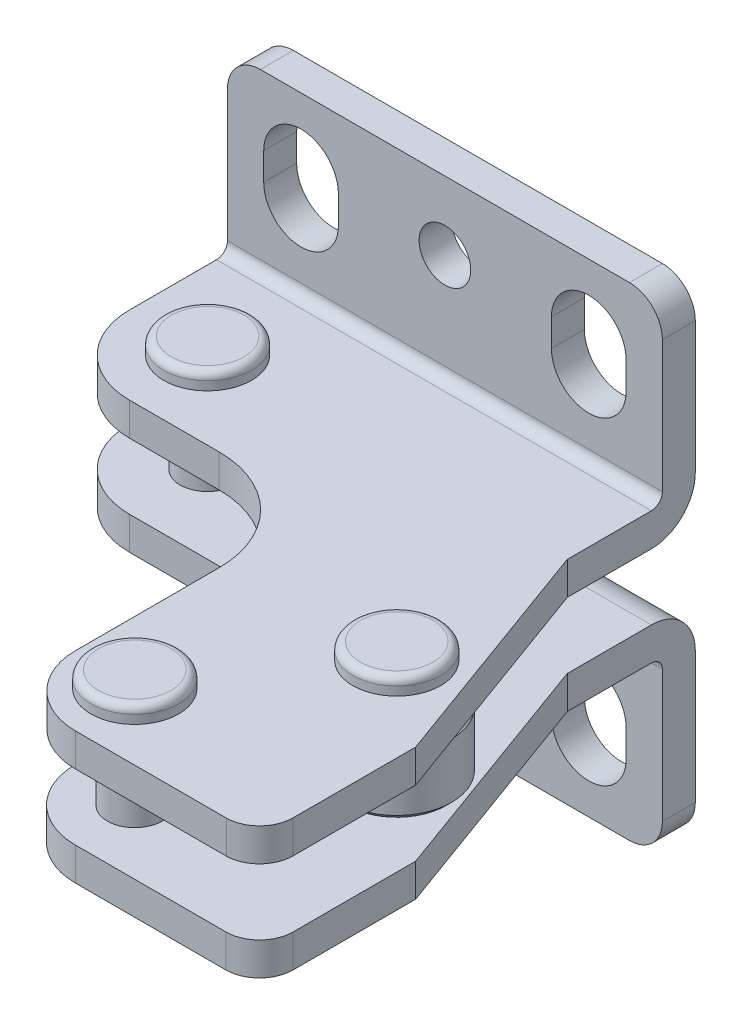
ISO-10303-21;
HEADER;
FILE_DESCRIPTION(('STEP AP214'),'2;1');
FILE_NAME('part.step','',(''),(''),'','','');
FILE_SCHEMA(('AUTOMOTIVE_DESIGN { 1 0 10303 214 1 1 1 1 }'));
ENDSEC;
DATA;
#1=APPLICATION_CONTEXT('core data for automotive mechanical design processes');
#2=APPLICATION_PROTOCOL_DEFINITION('international standard','automotive_design',2000,#1);
#3=PRODUCT_CONTEXT('',#1,'mechanical');
#4=PRODUCT('Part','Part','',(#3));
#5=PRODUCT_RELATED_PRODUCT_CATEGORY('part','',(#4));
#6=PRODUCT_DEFINITION_FORMATION('','',#4);
#7=PRODUCT_DEFINITION_CONTEXT('part definition',#1,'design');
#8=PRODUCT_DEFINITION('design','',#6,#7);
#9=PRODUCT_DEFINITION_SHAPE('','',#8);
#10=(LENGTH_UNIT() NAMED_UNIT(*) SI_UNIT(.MILLI.,.METRE.));
#11=(NAMED_UNIT(*) PLANE_ANGLE_UNIT() SI_UNIT($,.RADIAN.));
#12=(NAMED_UNIT(*) SI_UNIT($,.STERADIAN.) SOLID_ANGLE_UNIT());
#13=UNCERTAINTY_MEASURE_WITH_UNIT(LENGTH_MEASURE(1.E-05),#10,'distance_accuracy_value','');
#14=(GEOMETRIC_REPRESENTATION_CONTEXT(3) GLOBAL_UNCERTAINTY_ASSIGNED_CONTEXT((#13)) GLOBAL_UNIT_ASSIGNED_CONTEXT((#10,
#11,#12)) REPRESENTATION_CONTEXT('',''));
#15=CARTESIAN_POINT('',(0.,0.,0.));
#16=DIRECTION('',(0.,0.,1.));
#17=DIRECTION('',(1.,0.,0.));
#18=AXIS2_PLACEMENT_3D('',#15,#16,#17);
#19=CARTESIAN_POINT('',(-3.70000000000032,12.7515045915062,-11.9284954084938));
#20=DIRECTION('',(0.,-1.,0.));
#21=DIRECTION('',(1.,0.,0.));
#22=AXIS2_PLACEMENT_3D('',#19,#20,#21);
#23=PLANE('',#22);
#24=CARTESIAN_POINT('',(33.2994,12.7515045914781,27.5844383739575));
#25=DIRECTION('',(0.,1.,0.));
#26=DIRECTION('',(-0.605542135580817,0.,0.795813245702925));
#27=AXIS2_PLACEMENT_3D('',#24,#25,#26);
#28=CIRCLE('',#27,4.49999999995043);
#29=CARTESIAN_POINT('',(30.5744603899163,12.7515045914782,31.1655979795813));
#30=VERTEX_POINT('',#29);
#31=EDGE_CURVE('E581',#30,#30,#28,.T.);
#32=ORIENTED_EDGE('',*,*,#31,.F.);
#33=EDGE_LOOP('',(#32));
#34=FACE_BOUND('',#33,.T.);
#35=DIRECTION('',(1.,0.,0.));
#36=VECTOR('',#35,1.);
#37=CARTESIAN_POINT('',(-3.70000000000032,12.7515045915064,3.99999999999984));
#38=LINE('',#37,#36);
#39=CARTESIAN_POINT('',(-6.7000000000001,12.7515045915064,3.99999999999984));
#40=VERTEX_POINT('',#39);
#41=CARTESIAN_POINT('',(32.8999999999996,12.7515045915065,3.99999999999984));
#42=VERTEX_POINT('',#41);
#43=EDGE_CURVE('E473',#40,#42,#38,.T.);
#44=ORIENTED_EDGE('',*,*,#43,.F.);
#45=DIRECTION('',(0.,0.,1.));
#46=VECTOR('',#45,1.);
#47=CARTESIAN_POINT('',(-6.7000000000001,12.7515045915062,-11.9284954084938));
#48=LINE('',#47,#46);
#49=CARTESIAN_POINT('',(-6.7,12.7515045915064,11.9228383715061));
#50=VERTEX_POINT('',#49);
#51=EDGE_CURVE('E426',#50,#40,#48,.F.);
#52=ORIENTED_EDGE('',*,*,#51,.F.);
#53=CARTESIAN_POINT('',(0.4120000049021,12.7515045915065,11.9228383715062));
#54=DIRECTION('',(0.,1.,0.));
#55=DIRECTION('',(-1.,0.,0.));
#56=AXIS2_PLACEMENT_3D('',#53,#54,#55);
#57=CIRCLE('',#56,7.1120000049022);
#58=CARTESIAN_POINT('',(0.41200000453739,12.7515045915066,19.0348383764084));
#59=VERTEX_POINT('',#58);
#60=EDGE_CURVE('E422',#59,#50,#57,.F.);
#61=ORIENTED_EDGE('',*,*,#60,.F.);
#62=DIRECTION('',(1.,0.,0.));
#63=VECTOR('',#62,1.);
#64=CARTESIAN_POINT('',(-3.70000000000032,12.7515045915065,19.0348383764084));
#65=LINE('',#64,#63);
#66=CARTESIAN_POINT('',(8.56540000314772,12.7515045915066,19.0348383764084));
#67=VERTEX_POINT('',#66);
#68=EDGE_CURVE('E427',#67,#59,#65,.F.);
#69=ORIENTED_EDGE('',*,*,#68,.F.);
#70=CARTESIAN_POINT('',(8.54140000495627,12.7515045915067,28.1788068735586));
#71=DIRECTION('',(0.,1.,0.));
#72=DIRECTION('',(-1.,0.,0.));
#73=AXIS2_PLACEMENT_3D('',#70,#71,#72);
#74=CIRCLE('',#73,9.14399999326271);
#75=CARTESIAN_POINT('',(17.6853999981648,12.7515045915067,28.1788383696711));
#76=VERTEX_POINT('',#75);
#77=EDGE_CURVE('E428',#76,#67,#74,.T.);
#78=ORIENTED_EDGE('',*,*,#77,.F.);
#79=DIRECTION('',(0.,0.,1.));
#80=VECTOR('',#79,1.);
#81=CARTESIAN_POINT('',(17.6853999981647,12.7515045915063,-11.9284954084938));
#82=LINE('',#81,#80);
#83=CARTESIAN_POINT('',(17.6853999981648,12.7515045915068,41.234438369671));
#84=VERTEX_POINT('',#83);
#85=EDGE_CURVE('E432',#84,#76,#82,.F.);
#86=ORIENTED_EDGE('',*,*,#85,.F.);
#87=CARTESIAN_POINT('',(24.0354000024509,12.7515045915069,41.234438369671));
#88=DIRECTION('',(0.,1.,0.));
#89=DIRECTION('',(-1.,0.,0.));
#90=AXIS2_PLACEMENT_3D('',#87,#88,#89);
#91=CIRCLE('',#90,6.35000000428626);
#92=CARTESIAN_POINT('',(24.035400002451,12.7515045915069,47.5844383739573));
#93=VERTEX_POINT('',#92);
#94=EDGE_CURVE('E433',#93,#84,#91,.F.);
#95=ORIENTED_EDGE('',*,*,#94,.F.);
#96=DIRECTION('',(1.,0.,0.));
#97=VECTOR('',#96,1.);
#98=CARTESIAN_POINT('',(-3.70000000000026,12.7515045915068,47.5844383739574));
#99=LINE('',#98,#97);
#100=CARTESIAN_POINT('',(37.7514000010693,12.751504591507,47.5844383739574));
#101=VERTEX_POINT('',#100);
#102=EDGE_CURVE('E437',#101,#93,#99,.F.);
#103=ORIENTED_EDGE('',*,*,#102,.F.);
#104=CARTESIAN_POINT('',(37.7514,12.751504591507,44.5364383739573));
#105=DIRECTION('',(0.,1.,0.));
#106=DIRECTION('',(-1.,0.,0.));
#107=AXIS2_PLACEMENT_3D('',#104,#105,#106);
#108=CIRCLE('',#107,3.048);
#109=CARTESIAN_POINT('',(40.7993999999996,12.751504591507,44.5364383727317));
#110=VERTEX_POINT('',#109);
#111=EDGE_CURVE('E438',#110,#101,#108,.F.);
#112=ORIENTED_EDGE('',*,*,#111,.F.);
#113=DIRECTION('',(0.,0.,1.));
#114=VECTOR('',#113,1.);
#115=CARTESIAN_POINT('',(40.7993999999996,12.7515045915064,-11.9284954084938));
#116=LINE('',#115,#114);
#117=CARTESIAN_POINT('',(40.7993999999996,12.7515045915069,33.3604383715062));
#118=VERTEX_POINT('',#117);
#119=EDGE_CURVE('E442',#118,#110,#116,.T.);
#120=ORIENTED_EDGE('',*,*,#119,.F.);
#121=DIRECTION('',(0.34202014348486,0.,0.939692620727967));
#122=VECTOR('',#121,1.);
#123=CARTESIAN_POINT('',(32.8999999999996,12.7515045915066,11.6570152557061));
#124=LINE('',#123,#122);
#125=CARTESIAN_POINT('',(32.8999999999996,12.7515045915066,11.6570152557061));
#126=VERTEX_POINT('',#125);
#127=EDGE_CURVE('E1374',#126,#118,#124,.T.);
#128=ORIENTED_EDGE('',*,*,#127,.F.);
#129=DIRECTION('',(0.,0.,1.));
#130=VECTOR('',#129,1.);
#131=CARTESIAN_POINT('',(32.8999999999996,12.7515045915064,-11.9284954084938));
#132=LINE('',#131,#130);
#133=EDGE_CURVE('E1389',#42,#126,#132,.T.);
#134=ORIENTED_EDGE('',*,*,#133,.F.);
#135=EDGE_LOOP('',(#44,#52,#61,#69,#78,#86,#95,#103,#112,#120,#128,#134));
#136=FACE_BOUND('',#135,.T.);
#137=CARTESIAN_POINT('',(0.41200000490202,12.7515045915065,11.9228383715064));
#138=DIRECTION('',(0.,-1.,0.));
#139=DIRECTION('',(1.,0.,0.));
#140=AXIS2_PLACEMENT_3D('',#137,#138,#139);
#141=CIRCLE('',#140,2.5);
#142=CARTESIAN_POINT('',(2.91200000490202,12.7515045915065,11.9228383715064));
#143=VERTEX_POINT('',#142);
#144=EDGE_CURVE('E938',#143,#143,#141,.F.);
#145=ORIENTED_EDGE('',*,*,#144,.F.);
#146=EDGE_LOOP('',(#145));
#147=FACE_BOUND('',#146,.T.);
#148=CARTESIAN_POINT('',(23.6022,12.7515045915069,41.7424383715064));
#149=DIRECTION('',(0.,-1.,0.));
#150=DIRECTION('',(1.,0.,0.));
#151=AXIS2_PLACEMENT_3D('',#148,#149,#150);
#152=CIRCLE('',#151,2.5);
#153=CARTESIAN_POINT('',(26.1022,12.7515045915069,41.7424383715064));
#154=VERTEX_POINT('',#153);
#155=EDGE_CURVE('E1092',#154,#154,#152,.F.);
#156=ORIENTED_EDGE('',*,*,#155,.F.);
#157=EDGE_LOOP('',(#156));
#158=FACE_BOUND('',#157,.T.);
#159=ADVANCED_FACE('F20',(#34,#136,#147,#158),#23,.F.);
#160=CARTESIAN_POINT('',(-26.8071579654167,8.7515045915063,3.99999999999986));
#161=DIRECTION('',(1.,0.,0.));
#162=DIRECTION('',(0.,1.,0.));
#163=AXIS2_PLACEMENT_3D('',#160,#161,#162);
#164=CYLINDRICAL_SURFACE('',#163,4.);
#165=DIRECTION('',(1.,0.,0.));
#166=VECTOR('',#165,1.);
#167=CARTESIAN_POINT('',(-26.8071579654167,8.75150459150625,-1.38561037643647E-13));
#168=LINE('',#167,#166);
#169=CARTESIAN_POINT('',(32.8999999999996,8.7515045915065,-1.38561037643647E-13));
#170=VERTEX_POINT('',#169);
#171=CARTESIAN_POINT('',(-6.7000000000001,8.75150459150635,-1.38561037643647E-13));
#172=VERTEX_POINT('',#171);
#173=EDGE_CURVE('E447',#170,#172,#168,.F.);
#174=ORIENTED_EDGE('',*,*,#173,.T.);
#175=CARTESIAN_POINT('',(-6.7000000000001,8.7515045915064,3.99999999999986));
#176=DIRECTION('',(1.,0.,0.));
#177=DIRECTION('',(0.,1.,0.));
#178=AXIS2_PLACEMENT_3D('',#175,#176,#177);
#179=CIRCLE('',#178,4.);
#180=EDGE_CURVE('E443',#172,#40,#179,.T.);
#181=ORIENTED_EDGE('',*,*,#180,.T.);
#182=ORIENTED_EDGE('',*,*,#43,.T.);
#183=CARTESIAN_POINT('',(32.8999999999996,8.75150459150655,3.99999999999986));
#184=DIRECTION('',(1.,0.,0.));
#185=DIRECTION('',(0.,1.,0.));
#186=AXIS2_PLACEMENT_3D('',#183,#184,#185);
#187=CIRCLE('',#186,4.);
#188=EDGE_CURVE('E448',#42,#170,#187,.F.);
#189=ORIENTED_EDGE('',*,*,#188,.T.);
#190=EDGE_LOOP('',(#174,#181,#182,#189));
#191=FACE_BOUND('',#190,.T.);
#192=ADVANCED_FACE('F1528',(#191),#164,.T.);
#193=CARTESIAN_POINT('',(-6.7000000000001,9.75150459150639,3.23603837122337));
#194=DIRECTION('',(1.,0.,0.));
#195=DIRECTION('',(0.,0.,1.));
#196=AXIS2_PLACEMENT_3D('',#193,#194,#195);
#197=PLANE('',#196);
#198=ORIENTED_EDGE('',*,*,#51,.T.);
#199=ORIENTED_EDGE('',*,*,#180,.F.);
#200=DIRECTION('',(0.,-1.,0.));
#201=VECTOR('',#200,1.);
#202=CARTESIAN_POINT('',(-6.7,-3.25,0.));
#203=LINE('',#202,#201);
#204=CARTESIAN_POINT('',(-6.70000000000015,-3.25,0.));
#205=VERTEX_POINT('',#204);
#206=EDGE_CURVE('E526',#172,#205,#203,.T.);
#207=ORIENTED_EDGE('',*,*,#206,.T.);
#208=DIRECTION('',(0.,0.,1.));
#209=VECTOR('',#208,1.);
#210=CARTESIAN_POINT('',(-6.70000000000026,-3.2499999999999,2.99999999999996));
#211=LINE('',#210,#209);
#212=CARTESIAN_POINT('',(-6.70000000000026,-3.2499999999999,3.));
#213=VERTEX_POINT('',#212);
#214=EDGE_CURVE('E1162',#213,#205,#211,.F.);
#215=ORIENTED_EDGE('',*,*,#214,.F.);
#216=DIRECTION('',(0.,1.,0.));
#217=VECTOR('',#216,1.);
#218=CARTESIAN_POINT('',(-6.7000000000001,11.9145337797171,2.99999999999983));
#219=LINE('',#218,#217);
#220=CARTESIAN_POINT('',(-6.70000000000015,8.75150459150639,2.99999999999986));
#221=VERTEX_POINT('',#220);
#222=EDGE_CURVE('E1462',#221,#213,#219,.F.);
#223=ORIENTED_EDGE('',*,*,#222,.F.);
#224=CARTESIAN_POINT('',(-6.7000000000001,8.7515045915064,3.99999999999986));
#225=DIRECTION('',(1.,0.,0.));
#226=DIRECTION('',(0.,1.,0.));
#227=AXIS2_PLACEMENT_3D('',#224,#225,#226);
#228=CIRCLE('',#227,1.);
#229=CARTESIAN_POINT('',(-6.7000000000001,9.7515045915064,3.99999999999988));
#230=VERTEX_POINT('',#229);
#231=EDGE_CURVE('E512',#230,#221,#228,.F.);
#232=ORIENTED_EDGE('',*,*,#231,.F.);
#233=DIRECTION('',(0.,0.,1.));
#234=VECTOR('',#233,1.);
#235=CARTESIAN_POINT('',(-6.7000000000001,9.75150459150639,3.23603837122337));
#236=LINE('',#235,#234);
#237=CARTESIAN_POINT('',(-6.7,9.75150459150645,11.9228383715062));
#238=VERTEX_POINT('',#237);
#239=EDGE_CURVE('E451',#238,#230,#236,.F.);
#240=ORIENTED_EDGE('',*,*,#239,.F.);
#241=DIRECTION('',(0.,-1.,0.));
#242=VECTOR('',#241,1.);
#243=CARTESIAN_POINT('',(-6.7,9.75150459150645,11.9228383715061));
#244=LINE('',#243,#242);
#245=EDGE_CURVE('E472',#50,#238,#244,.T.);
#246=ORIENTED_EDGE('',*,*,#245,.F.);
#247=EDGE_LOOP('',(#198,#199,#207,#215,#223,#232,#240,#246));
#248=FACE_BOUND('',#247,.T.);
#249=ADVANCED_FACE('F1358',(#248),#197,.F.);
#250=CARTESIAN_POINT('',(0.4120000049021,9.7515045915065,11.9228383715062));
#251=DIRECTION('',(0.,1.,0.));
#252=DIRECTION('',(-1.,0.,0.));
#253=AXIS2_PLACEMENT_3D('',#250,#251,#252);
#254=CYLINDRICAL_SURFACE('',#253,7.1120000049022);
#255=CARTESIAN_POINT('',(0.4120000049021,9.7515045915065,11.9228383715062));
#256=DIRECTION('',(0.,1.,0.));
#257=DIRECTION('',(-1.,0.,0.));
#258=AXIS2_PLACEMENT_3D('',#255,#256,#257);
#259=CIRCLE('',#258,7.1120000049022);
#260=CARTESIAN_POINT('',(0.41200000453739,9.75150459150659,19.0348383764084));
#261=VERTEX_POINT('',#260);
#262=EDGE_CURVE('E452',#238,#261,#259,.T.);
#263=ORIENTED_EDGE('',*,*,#262,.T.);
#264=DIRECTION('',(0.,1.,0.));
#265=VECTOR('',#264,1.);
#266=CARTESIAN_POINT('',(0.41200000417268,9.75150459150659,19.0348383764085));
#267=LINE('',#266,#265);
#268=EDGE_CURVE('E456',#261,#59,#267,.T.);
#269=ORIENTED_EDGE('',*,*,#268,.T.);
#270=ORIENTED_EDGE('',*,*,#60,.T.);
#271=ORIENTED_EDGE('',*,*,#245,.T.);
#272=EDGE_LOOP('',(#263,#269,#270,#271));
#273=FACE_BOUND('',#272,.T.);
#274=ADVANCED_FACE('F1363',(#273),#254,.T.);
#275=CARTESIAN_POINT('',(0.41200000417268,9.75150459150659,19.0348383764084));
#276=DIRECTION('',(0.,0.,-1.));
#277=DIRECTION('',(0.,1.,0.));
#278=AXIS2_PLACEMENT_3D('',#275,#276,#277);
#279=PLANE('',#278);
#280=ORIENTED_EDGE('',*,*,#268,.F.);
#281=DIRECTION('',(1.,0.,0.));
#282=VECTOR('',#281,1.);
#283=CARTESIAN_POINT('',(0.41200000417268,9.75150459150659,19.0348383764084));
#284=LINE('',#283,#282);
#285=CARTESIAN_POINT('',(8.56540000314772,9.75150459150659,19.0348383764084));
#286=VERTEX_POINT('',#285);
#287=EDGE_CURVE('E457',#286,#261,#284,.F.);
#288=ORIENTED_EDGE('',*,*,#287,.F.);
#289=DIRECTION('',(0.,1.,0.));
#290=VECTOR('',#289,1.);
#291=CARTESIAN_POINT('',(8.56540000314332,9.75150459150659,19.0348383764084));
#292=LINE('',#291,#290);
#293=EDGE_CURVE('E476',#67,#286,#292,.F.);
#294=ORIENTED_EDGE('',*,*,#293,.F.);
#295=ORIENTED_EDGE('',*,*,#68,.T.);
#296=EDGE_LOOP('',(#280,#288,#294,#295));
#297=FACE_BOUND('',#296,.T.);
#298=ADVANCED_FACE('F1778',(#297),#279,.F.);
#299=CARTESIAN_POINT('',(8.54140000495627,9.75150459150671,28.1788068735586));
#300=DIRECTION('',(0.,1.,0.));
#301=DIRECTION('',(-1.,0.,0.));
#302=AXIS2_PLACEMENT_3D('',#299,#300,#301);
#303=CYLINDRICAL_SURFACE('',#302,9.14399999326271);
#304=ORIENTED_EDGE('',*,*,#293,.T.);
#305=CARTESIAN_POINT('',(8.54140000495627,9.75150459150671,28.1788068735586));
#306=DIRECTION('',(0.,1.,0.));
#307=DIRECTION('',(-1.,0.,0.));
#308=AXIS2_PLACEMENT_3D('',#305,#306,#307);
#309=CIRCLE('',#308,9.14399999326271);
#310=CARTESIAN_POINT('',(17.6853999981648,9.75150459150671,28.1788383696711));
#311=VERTEX_POINT('',#310);
#312=EDGE_CURVE('E458',#311,#286,#309,.T.);
#313=ORIENTED_EDGE('',*,*,#312,.F.);
#314=DIRECTION('',(0.,1.,0.));
#315=VECTOR('',#314,1.);
#316=CARTESIAN_POINT('',(17.6853999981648,9.75150459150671,28.1788383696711));
#317=LINE('',#316,#315);
#318=EDGE_CURVE('E480',#76,#311,#317,.F.);
#319=ORIENTED_EDGE('',*,*,#318,.F.);
#320=ORIENTED_EDGE('',*,*,#77,.T.);
#321=EDGE_LOOP('',(#304,#313,#319,#320));
#322=FACE_BOUND('',#321,.T.);
#323=ADVANCED_FACE('F1789',(#322),#303,.F.);
#324=CARTESIAN_POINT('',(17.6853999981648,9.75150459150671,28.1788383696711));
#325=DIRECTION('',(1.,0.,0.));
#326=DIRECTION('',(0.,0.,1.));
#327=AXIS2_PLACEMENT_3D('',#324,#325,#326);
#328=PLANE('',#327);
#329=ORIENTED_EDGE('',*,*,#318,.T.);
#330=DIRECTION('',(0.,0.,1.));
#331=VECTOR('',#330,1.);
#332=CARTESIAN_POINT('',(17.6853999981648,9.75150459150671,28.1788383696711));
#333=LINE('',#332,#331);
#334=CARTESIAN_POINT('',(17.6853999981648,9.75150459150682,41.234438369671));
#335=VERTEX_POINT('',#334);
#336=EDGE_CURVE('E484',#335,#311,#333,.F.);
#337=ORIENTED_EDGE('',*,*,#336,.F.);
#338=DIRECTION('',(0.,-1.,0.));
#339=VECTOR('',#338,1.);
#340=CARTESIAN_POINT('',(17.6853999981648,9.75150459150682,41.234438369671));
#341=LINE('',#340,#339);
#342=EDGE_CURVE('E485',#84,#335,#341,.T.);
#343=ORIENTED_EDGE('',*,*,#342,.F.);
#344=ORIENTED_EDGE('',*,*,#85,.T.);
#345=EDGE_LOOP('',(#329,#337,#343,#344));
#346=FACE_BOUND('',#345,.T.);
#347=ADVANCED_FACE('F1801',(#346),#328,.F.);
#348=CARTESIAN_POINT('',(24.0354000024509,9.75150459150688,41.2344383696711));
#349=DIRECTION('',(0.,1.,0.));
#350=DIRECTION('',(-1.,0.,0.));
#351=AXIS2_PLACEMENT_3D('',#348,#349,#350);
#352=CYLINDRICAL_SURFACE('',#351,6.35000000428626);
#353=CARTESIAN_POINT('',(24.0354000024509,9.75150459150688,41.2344383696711));
#354=DIRECTION('',(0.,1.,0.));
#355=DIRECTION('',(-1.,0.,0.));
#356=AXIS2_PLACEMENT_3D('',#353,#354,#355);
#357=CIRCLE('',#356,6.35000000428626);
#358=CARTESIAN_POINT('',(24.035400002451,9.75150459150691,47.5844383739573));
#359=VERTEX_POINT('',#358);
#360=EDGE_CURVE('E493',#335,#359,#357,.T.);
#361=ORIENTED_EDGE('',*,*,#360,.T.);
#362=DIRECTION('',(0.,1.,0.));
#363=VECTOR('',#362,1.);
#364=CARTESIAN_POINT('',(24.035400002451,9.75150459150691,47.5844383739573));
#365=LINE('',#364,#363);
#366=EDGE_CURVE('E489',#359,#93,#365,.T.);
#367=ORIENTED_EDGE('',*,*,#366,.T.);
#368=ORIENTED_EDGE('',*,*,#94,.T.);
#369=ORIENTED_EDGE('',*,*,#342,.T.);
#370=EDGE_LOOP('',(#361,#367,#368,#369));
#371=FACE_BOUND('',#370,.T.);
#372=ADVANCED_FACE('F1813',(#371),#352,.T.);
#373=CARTESIAN_POINT('',(24.035400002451,9.75150459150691,47.5844383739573));
#374=DIRECTION('',(0.,0.,-1.));
#375=DIRECTION('',(1.,0.,0.));
#376=AXIS2_PLACEMENT_3D('',#373,#374,#375);
#377=PLANE('',#376);
#378=ORIENTED_EDGE('',*,*,#366,.F.);
#379=DIRECTION('',(1.,0.,0.));
#380=VECTOR('',#379,1.);
#381=CARTESIAN_POINT('',(24.035400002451,9.75150459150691,47.5844383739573));
#382=LINE('',#381,#380);
#383=CARTESIAN_POINT('',(37.7514000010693,9.75150459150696,47.5844383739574));
#384=VERTEX_POINT('',#383);
#385=EDGE_CURVE('E1508',#384,#359,#382,.F.);
#386=ORIENTED_EDGE('',*,*,#385,.F.);
#387=DIRECTION('',(0.,-1.,0.));
#388=VECTOR('',#387,1.);
#389=CARTESIAN_POINT('',(37.7514000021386,9.75150459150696,47.5844383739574));
#390=LINE('',#389,#388);
#391=EDGE_CURVE('E494',#101,#384,#390,.T.);
#392=ORIENTED_EDGE('',*,*,#391,.F.);
#393=ORIENTED_EDGE('',*,*,#102,.T.);
#394=EDGE_LOOP('',(#378,#386,#392,#393));
#395=FACE_BOUND('',#394,.T.);
#396=ADVANCED_FACE('F1825',(#395),#377,.F.);
#397=CARTESIAN_POINT('',(37.7514,9.75150459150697,44.5364383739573));
#398=DIRECTION('',(0.,1.,0.));
#399=DIRECTION('',(-1.,0.,0.));
#400=AXIS2_PLACEMENT_3D('',#397,#398,#399);
#401=CYLINDRICAL_SURFACE('',#400,3.048);
#402=CARTESIAN_POINT('',(37.7514,9.75150459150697,44.5364383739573));
#403=DIRECTION('',(0.,1.,0.));
#404=DIRECTION('',(-1.,0.,0.));
#405=AXIS2_PLACEMENT_3D('',#402,#403,#404);
#406=CIRCLE('',#405,3.048);
#407=CARTESIAN_POINT('',(40.7993999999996,9.75150459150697,44.5364383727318));
#408=VERTEX_POINT('',#407);
#409=EDGE_CURVE('E500',#384,#408,#406,.T.);
#410=ORIENTED_EDGE('',*,*,#409,.T.);
#411=DIRECTION('',(0.,1.,0.));
#412=VECTOR('',#411,1.);
#413=CARTESIAN_POINT('',(40.7993999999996,9.75150459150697,44.5364383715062));
#414=LINE('',#413,#412);
#415=EDGE_CURVE('E504',#408,#110,#414,.T.);
#416=ORIENTED_EDGE('',*,*,#415,.T.);
#417=ORIENTED_EDGE('',*,*,#111,.T.);
#418=ORIENTED_EDGE('',*,*,#391,.T.);
#419=EDGE_LOOP('',(#410,#416,#417,#418));
#420=FACE_BOUND('',#419,.T.);
#421=ADVANCED_FACE('F1837',(#420),#401,.T.);
#422=CARTESIAN_POINT('',(40.7993999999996,9.75150459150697,44.5364383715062));
#423=DIRECTION('',(-1.,0.,0.));
#424=DIRECTION('',(0.,-1.,0.));
#425=AXIS2_PLACEMENT_3D('',#422,#423,#424);
#426=PLANE('',#425);
#427=ORIENTED_EDGE('',*,*,#415,.F.);
#428=DIRECTION('',(0.,0.,1.));
#429=VECTOR('',#428,1.);
#430=CARTESIAN_POINT('',(40.7993999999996,9.75150459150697,44.5364383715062));
#431=LINE('',#430,#429);
#432=CARTESIAN_POINT('',(40.7993999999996,9.75150459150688,33.3604383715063));
#433=VERTEX_POINT('',#432);
#434=EDGE_CURVE('E505',#433,#408,#431,.T.);
#435=ORIENTED_EDGE('',*,*,#434,.F.);
#436=DIRECTION('',(0.,-1.,0.));
#437=VECTOR('',#436,1.);
#438=CARTESIAN_POINT('',(40.7993999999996,9.75150459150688,33.3604383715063));
#439=LINE('',#438,#437);
#440=EDGE_CURVE('E1422',#118,#433,#439,.T.);
#441=ORIENTED_EDGE('',*,*,#440,.F.);
#442=ORIENTED_EDGE('',*,*,#119,.T.);
#443=EDGE_LOOP('',(#427,#435,#441,#442));
#444=FACE_BOUND('',#443,.T.);
#445=ADVANCED_FACE('F1849',(#444),#426,.F.);
#446=CARTESIAN_POINT('',(40.7993999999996,9.75150459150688,33.3604383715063));
#447=DIRECTION('',(-0.939692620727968,0.,0.342020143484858));
#448=DIRECTION('',(-0.342020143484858,0.,-0.939692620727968));
#449=AXIS2_PLACEMENT_3D('',#446,#447,#448);
#450=PLANE('',#449);
#451=ORIENTED_EDGE('',*,*,#440,.T.);
#452=DIRECTION('',(-0.342020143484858,0.,-0.939692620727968));
#453=VECTOR('',#452,1.);
#454=CARTESIAN_POINT('',(40.7993999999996,9.75150459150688,33.3604383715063));
#455=LINE('',#454,#453);
#456=CARTESIAN_POINT('',(32.8999999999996,9.75150459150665,11.6570152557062));
#457=VERTEX_POINT('',#456);
#458=EDGE_CURVE('E1435',#457,#433,#455,.F.);
#459=ORIENTED_EDGE('',*,*,#458,.F.);
#460=DIRECTION('',(0.,-1.,0.));
#461=VECTOR('',#460,1.);
#462=CARTESIAN_POINT('',(32.8999999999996,9.75150459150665,11.6570152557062));
#463=LINE('',#462,#461);
#464=EDGE_CURVE('E446',#457,#126,#463,.F.);
#465=ORIENTED_EDGE('',*,*,#464,.T.);
#466=ORIENTED_EDGE('',*,*,#127,.T.);
#467=EDGE_LOOP('',(#451,#459,#465,#466));
#468=FACE_BOUND('',#467,.T.);
#469=ADVANCED_FACE('F1434',(#468),#450,.F.);
#470=CARTESIAN_POINT('',(32.8999999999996,9.75150459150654,3.23603837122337));
#471=DIRECTION('',(-1.,0.,0.));
#472=DIRECTION('',(0.,-1.,0.));
#473=AXIS2_PLACEMENT_3D('',#470,#471,#472);
#474=PLANE('',#473);
#475=DIRECTION('',(0.,0.,1.));
#476=VECTOR('',#475,1.);
#477=CARTESIAN_POINT('',(32.8999999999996,9.75150459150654,3.23603837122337));
#478=LINE('',#477,#476);
#479=CARTESIAN_POINT('',(32.8999999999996,9.75150459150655,3.99999999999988));
#480=VERTEX_POINT('',#479);
#481=EDGE_CURVE('E1410',#480,#457,#478,.T.);
#482=ORIENTED_EDGE('',*,*,#481,.F.);
#483=CARTESIAN_POINT('',(32.8999999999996,8.75150459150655,3.99999999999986));
#484=DIRECTION('',(1.,0.,0.));
#485=DIRECTION('',(0.,1.,0.));
#486=AXIS2_PLACEMENT_3D('',#483,#484,#485);
#487=CIRCLE('',#486,1.);
#488=CARTESIAN_POINT('',(32.8999999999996,8.75150459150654,2.99999999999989));
#489=VERTEX_POINT('',#488);
#490=EDGE_CURVE('E507',#489,#480,#487,.T.);
#491=ORIENTED_EDGE('',*,*,#490,.F.);
#492=DIRECTION('',(0.,-1.,0.));
#493=VECTOR('',#492,1.);
#494=CARTESIAN_POINT('',(32.8999999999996,11.9145337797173,2.99999999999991));
#495=LINE('',#494,#493);
#496=CARTESIAN_POINT('',(32.8999999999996,-3.24999999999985,3.00000000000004));
#497=VERTEX_POINT('',#496);
#498=EDGE_CURVE('E1445',#497,#489,#495,.F.);
#499=ORIENTED_EDGE('',*,*,#498,.F.);
#500=DIRECTION('',(0.,0.,1.));
#501=VECTOR('',#500,1.);
#502=CARTESIAN_POINT('',(32.8999999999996,-3.24999999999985,2.99999999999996));
#503=LINE('',#502,#501);
#504=CARTESIAN_POINT('',(32.8999999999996,-3.2499999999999,0.));
#505=VERTEX_POINT('',#504);
#506=EDGE_CURVE('E1450',#505,#497,#503,.T.);
#507=ORIENTED_EDGE('',*,*,#506,.F.);
#508=DIRECTION('',(0.,-1.,0.));
#509=VECTOR('',#508,1.);
#510=CARTESIAN_POINT('',(32.8999999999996,-3.24999999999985,0.));
#511=LINE('',#510,#509);
#512=EDGE_CURVE('E516',#505,#170,#511,.F.);
#513=ORIENTED_EDGE('',*,*,#512,.T.);
#514=ORIENTED_EDGE('',*,*,#188,.F.);
#515=ORIENTED_EDGE('',*,*,#133,.T.);
#516=ORIENTED_EDGE('',*,*,#464,.F.);
#517=EDGE_LOOP('',(#482,#491,#499,#507,#513,#514,#515,#516));
#518=FACE_BOUND('',#517,.T.);
#519=ADVANCED_FACE('F1437',(#518),#474,.F.);
#520=CARTESIAN_POINT('',(-3.70000000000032,18.7515045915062,-11.9284954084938));
#521=DIRECTION('',(0.,-1.,0.));
#522=DIRECTION('',(1.,0.,0.));
#523=AXIS2_PLACEMENT_3D('',#520,#521,#522);
#524=PLANE('',#523);
#525=CARTESIAN_POINT('',(33.2994,18.7515045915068,27.5844383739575));
#526=DIRECTION('',(0.,-1.,0.));
#527=DIRECTION('',(0.605542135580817,0.,-0.795813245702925));
#528=AXIS2_PLACEMENT_3D('',#525,#526,#527);
#529=CIRCLE('',#528,4.50000000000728);
#530=CARTESIAN_POINT('',(36.0243396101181,18.7515045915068,24.0032787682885));
#531=VERTEX_POINT('',#530);
#532=EDGE_CURVE('E576',#531,#531,#529,.T.);
#533=ORIENTED_EDGE('',*,*,#532,.F.);
#534=EDGE_LOOP('',(#533));
#535=FACE_BOUND('',#534,.T.);
#536=CARTESIAN_POINT('',(23.6022,18.7515045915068,41.7424383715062));
#537=DIRECTION('',(0.,-1.,0.));
#538=DIRECTION('',(0.,0.,1.));
#539=AXIS2_PLACEMENT_3D('',#536,#537,#538);
#540=CIRCLE('',#539,2.5);
#541=CARTESIAN_POINT('',(23.6022,18.7515045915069,44.2424383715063));
#542=VERTEX_POINT('',#541);
#543=EDGE_CURVE('E1088',#542,#542,#540,.F.);
#544=ORIENTED_EDGE('',*,*,#543,.T.);
#545=EDGE_LOOP('',(#544));
#546=FACE_BOUND('',#545,.T.);
#547=CARTESIAN_POINT('',(0.41200000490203,18.7515045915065,11.9228383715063));
#548=DIRECTION('',(0.,-1.,0.));
#549=DIRECTION('',(0.,0.,1.));
#550=AXIS2_PLACEMENT_3D('',#547,#548,#549);
#551=CIRCLE('',#550,2.5);
#552=CARTESIAN_POINT('',(0.41200000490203,18.7515045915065,14.4228383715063));
#553=VERTEX_POINT('',#552);
#554=EDGE_CURVE('E933',#553,#553,#551,.F.);
#555=ORIENTED_EDGE('',*,*,#554,.T.);
#556=EDGE_LOOP('',(#555));
#557=FACE_BOUND('',#556,.T.);
#558=CARTESIAN_POINT('',(0.4120000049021,18.7515045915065,11.9228383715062));
#559=DIRECTION('',(0.,1.,0.));
#560=DIRECTION('',(-1.,0.,0.));
#561=AXIS2_PLACEMENT_3D('',#558,#559,#560);
#562=CIRCLE('',#561,7.1120000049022);
#563=CARTESIAN_POINT('',(0.4120000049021,18.7515045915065,19.0348383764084));
#564=VERTEX_POINT('',#563);
#565=CARTESIAN_POINT('',(-6.7000000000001,18.7515045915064,11.9228383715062));
#566=VERTEX_POINT('',#565);
#567=EDGE_CURVE('E927',#564,#566,#562,.F.);
#568=ORIENTED_EDGE('',*,*,#567,.T.);
#569=DIRECTION('',(0.,0.,1.));
#570=VECTOR('',#569,1.);
#571=CARTESIAN_POINT('',(-6.7000000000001,18.7515045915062,-11.9284954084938));
#572=LINE('',#571,#570);
#573=CARTESIAN_POINT('',(-6.70000000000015,18.7515045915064,3.99999999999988));
#574=VERTEX_POINT('',#573);
#575=EDGE_CURVE('E928',#566,#574,#572,.F.);
#576=ORIENTED_EDGE('',*,*,#575,.T.);
#577=DIRECTION('',(1.,0.,0.));
#578=VECTOR('',#577,1.);
#579=CARTESIAN_POINT('',(-3.70000000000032,18.7515045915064,3.99999999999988));
#580=LINE('',#579,#578);
#581=CARTESIAN_POINT('',(32.8999999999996,18.7515045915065,3.99999999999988));
#582=VERTEX_POINT('',#581);
#583=EDGE_CURVE('E862',#574,#582,#580,.T.);
#584=ORIENTED_EDGE('',*,*,#583,.T.);
#585=DIRECTION('',(0.,0.,1.));
#586=VECTOR('',#585,1.);
#587=CARTESIAN_POINT('',(32.8999999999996,18.7515045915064,-11.9284954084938));
#588=LINE('',#587,#586);
#589=CARTESIAN_POINT('',(32.8999999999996,18.7515045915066,11.6570152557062));
#590=VERTEX_POINT('',#589);
#591=EDGE_CURVE('E856',#582,#590,#588,.T.);
#592=ORIENTED_EDGE('',*,*,#591,.T.);
#593=DIRECTION('',(0.34202014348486,0.,0.939692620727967));
#594=VECTOR('',#593,1.);
#595=CARTESIAN_POINT('',(32.8999999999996,18.7515045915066,11.6570152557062));
#596=LINE('',#595,#594);
#597=CARTESIAN_POINT('',(40.7993999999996,18.7515045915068,33.3604383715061));
#598=VERTEX_POINT('',#597);
#599=EDGE_CURVE('E861',#590,#598,#596,.T.);
#600=ORIENTED_EDGE('',*,*,#599,.T.);
#601=DIRECTION('',(0.,0.,1.));
#602=VECTOR('',#601,1.);
#603=CARTESIAN_POINT('',(40.7993999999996,18.7515045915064,-11.9284954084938));
#604=LINE('',#603,#602);
#605=CARTESIAN_POINT('',(40.7993999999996,18.7515045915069,44.5364383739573));
#606=VERTEX_POINT('',#605);
#607=EDGE_CURVE('E871',#598,#606,#604,.T.);
#608=ORIENTED_EDGE('',*,*,#607,.T.);
#609=CARTESIAN_POINT('',(37.7514000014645,18.7515045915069,44.5365328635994));
#610=DIRECTION('',(0.,1.,0.));
#611=DIRECTION('',(-1.,0.,0.));
#612=AXIS2_PLACEMENT_3D('',#609,#610,#611);
#613=CIRCLE('',#612,3.048);
#614=CARTESIAN_POINT('',(37.7753999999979,18.751504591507,47.5844383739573));
#615=VERTEX_POINT('',#614);
#616=EDGE_CURVE('E912',#606,#615,#613,.F.);
#617=ORIENTED_EDGE('',*,*,#616,.T.);
#618=DIRECTION('',(1.,0.,0.));
#619=VECTOR('',#618,1.);
#620=CARTESIAN_POINT('',(-3.70000000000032,18.7515045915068,47.5844383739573));
#621=LINE('',#620,#619);
#622=CARTESIAN_POINT('',(24.0594000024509,18.7515045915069,47.5844383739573));
#623=VERTEX_POINT('',#622);
#624=EDGE_CURVE('E913',#615,#623,#621,.F.);
#625=ORIENTED_EDGE('',*,*,#624,.T.);
#626=CARTESIAN_POINT('',(24.0594000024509,18.7515045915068,41.234438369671));
#627=DIRECTION('',(0.,1.,0.));
#628=DIRECTION('',(-1.,0.,0.));
#629=AXIS2_PLACEMENT_3D('',#626,#627,#628);
#630=CIRCLE('',#629,6.35000000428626);
#631=CARTESIAN_POINT('',(17.7093999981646,18.7515045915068,41.234438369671));
#632=VERTEX_POINT('',#631);
#633=EDGE_CURVE('E917',#623,#632,#630,.F.);
#634=ORIENTED_EDGE('',*,*,#633,.T.);
#635=DIRECTION('',(0.,0.,1.));
#636=VECTOR('',#635,1.);
#637=CARTESIAN_POINT('',(17.7093999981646,18.7515045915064,-11.9284954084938));
#638=LINE('',#637,#636);
#639=CARTESIAN_POINT('',(17.7093999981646,18.7515045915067,28.1788383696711));
#640=VERTEX_POINT('',#639);
#641=EDGE_CURVE('E918',#632,#640,#638,.F.);
#642=ORIENTED_EDGE('',*,*,#641,.T.);
#643=CARTESIAN_POINT('',(8.56540000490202,18.7515045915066,28.1788383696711));
#644=DIRECTION('',(0.,1.,0.));
#645=DIRECTION('',(-1.,0.,0.));
#646=AXIS2_PLACEMENT_3D('',#643,#644,#645);
#647=CIRCLE('',#646,9.14399999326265);
#648=CARTESIAN_POINT('',(8.56540000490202,18.7515045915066,19.0348383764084));
#649=VERTEX_POINT('',#648);
#650=EDGE_CURVE('E922',#640,#649,#647,.T.);
#651=ORIENTED_EDGE('',*,*,#650,.T.);
#652=DIRECTION('',(1.,0.,0.));
#653=VECTOR('',#652,1.);
#654=CARTESIAN_POINT('',(-3.70000000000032,18.7515045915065,19.0348383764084));
#655=LINE('',#654,#653);
#656=EDGE_CURVE('E923',#649,#564,#655,.F.);
#657=ORIENTED_EDGE('',*,*,#656,.T.);
#658=EDGE_LOOP('',(#568,#576,#584,#592,#600,#608,#617,#625,#634,#642,#651,#657));
#659=FACE_BOUND('',#658,.T.);
#660=ADVANCED_FACE('F1881',(#535,#546,#557,#659),#524,.T.);
#661=CARTESIAN_POINT('',(23.6022,9.75150459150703,41.7424383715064));
#662=DIRECTION('',(0.,1.,0.));
#663=DIRECTION('',(-0.744331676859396,0.,-0.667810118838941));
#664=AXIS2_PLACEMENT_3D('',#661,#662,#663);
#665=CYLINDRICAL_SURFACE('',#664,2.5);
#666=ORIENTED_EDGE('',*,*,#543,.F.);
#667=EDGE_LOOP('',(#666));
#668=FACE_BOUND('',#667,.T.);
#669=ORIENTED_EDGE('',*,*,#155,.T.);
#670=EDGE_LOOP('',(#669));
#671=FACE_BOUND('',#670,.T.);
#672=ADVANCED_FACE('F755',(#668,#671),#665,.T.);
#673=CARTESIAN_POINT('',(0.41200000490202,9.55150459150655,11.9228383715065));
#674=DIRECTION('',(0.,1.,0.));
#675=DIRECTION('',(-0.744331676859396,0.,-0.667810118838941));
#676=AXIS2_PLACEMENT_3D('',#673,#674,#675);
#677=CYLINDRICAL_SURFACE('',#676,2.5);
#678=ORIENTED_EDGE('',*,*,#554,.F.);
#679=EDGE_LOOP('',(#678));
#680=FACE_BOUND('',#679,.T.);
#681=ORIENTED_EDGE('',*,*,#144,.T.);
#682=EDGE_LOOP('',(#681));
#683=FACE_BOUND('',#682,.T.);
#684=ADVANCED_FACE('F1746',(#680,#683),#677,.T.);
#685=CARTESIAN_POINT('',(0.4120000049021,18.7515045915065,11.9228383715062));
#686=DIRECTION('',(0.,1.,0.));
#687=DIRECTION('',(-1.,0.,0.));
#688=AXIS2_PLACEMENT_3D('',#685,#686,#687);
#689=CYLINDRICAL_SURFACE('',#688,7.1120000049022);
#690=ORIENTED_EDGE('',*,*,#567,.F.);
#691=DIRECTION('',(0.,1.,0.));
#692=VECTOR('',#691,1.);
#693=CARTESIAN_POINT('',(0.4120000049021,18.7515045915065,19.0348383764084));
#694=LINE('',#693,#692);
#695=CARTESIAN_POINT('',(0.4120000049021,21.7515045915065,19.0348383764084));
#696=VERTEX_POINT('',#695);
#697=EDGE_CURVE('E896',#564,#696,#694,.T.);
#698=ORIENTED_EDGE('',*,*,#697,.T.);
#699=CARTESIAN_POINT('',(0.4120000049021,21.7515045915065,11.9228383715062));
#700=DIRECTION('',(0.,1.,0.));
#701=DIRECTION('',(-1.,0.,0.));
#702=AXIS2_PLACEMENT_3D('',#699,#700,#701);
#703=CIRCLE('',#702,7.1120000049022);
#704=CARTESIAN_POINT('',(-6.7000000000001,21.7515045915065,11.9228383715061));
#705=VERTEX_POINT('',#704);
#706=EDGE_CURVE('E803',#696,#705,#703,.F.);
#707=ORIENTED_EDGE('',*,*,#706,.T.);
#708=DIRECTION('',(0.,-1.,0.));
#709=VECTOR('',#708,1.);
#710=CARTESIAN_POINT('',(-6.7000000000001,18.7515045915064,11.9228383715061));
#711=LINE('',#710,#709);
#712=EDGE_CURVE('E901',#705,#566,#711,.T.);
#713=ORIENTED_EDGE('',*,*,#712,.T.);
#714=EDGE_LOOP('',(#690,#698,#707,#713));
#715=FACE_BOUND('',#714,.T.);
#716=ADVANCED_FACE('F1913',(#715),#689,.T.);
#717=CARTESIAN_POINT('',(-6.7000000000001,18.7515045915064,11.9228383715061));
#718=DIRECTION('',(1.,0.,0.));
#719=DIRECTION('',(0.,0.,1.));
#720=AXIS2_PLACEMENT_3D('',#717,#718,#719);
#721=PLANE('',#720);
#722=DIRECTION('',(0.,0.,1.));
#723=VECTOR('',#722,1.);
#724=CARTESIAN_POINT('',(-6.7000000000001,21.7515045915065,11.9228383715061));
#725=LINE('',#724,#723);
#726=CARTESIAN_POINT('',(-6.70000000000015,21.7515045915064,3.99999999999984));
#727=VERTEX_POINT('',#726);
#728=EDGE_CURVE('E796',#727,#705,#725,.T.);
#729=ORIENTED_EDGE('',*,*,#728,.F.);
#730=CARTESIAN_POINT('',(-6.70000000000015,22.7515045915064,3.99999999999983));
#731=DIRECTION('',(1.,0.,0.));
#732=DIRECTION('',(0.,1.,0.));
#733=AXIS2_PLACEMENT_3D('',#730,#731,#732);
#734=CIRCLE('',#733,1.);
#735=CARTESIAN_POINT('',(-6.70000000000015,22.7515045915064,2.99999999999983));
#736=VERTEX_POINT('',#735);
#737=EDGE_CURVE('E795',#727,#736,#734,.T.);
#738=ORIENTED_EDGE('',*,*,#737,.T.);
#739=DIRECTION('',(0.,1.,0.));
#740=VECTOR('',#739,1.);
#741=CARTESIAN_POINT('',(-6.7,10.9016754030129,2.99999999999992));
#742=LINE('',#741,#740);
#743=CARTESIAN_POINT('',(-6.70000000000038,34.7530091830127,2.99999999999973));
#744=VERTEX_POINT('',#743);
#745=EDGE_CURVE('E1020',#744,#736,#742,.F.);
#746=ORIENTED_EDGE('',*,*,#745,.F.);
#747=DIRECTION('',(0.,0.,1.));
#748=VECTOR('',#747,1.);
#749=CARTESIAN_POINT('',(-6.70000000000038,34.7530091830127,-3.59304599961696E-13));
#750=LINE('',#749,#748);
#751=CARTESIAN_POINT('',(-6.70000000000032,34.7530091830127,-2.19225679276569E-13));
#752=VERTEX_POINT('',#751);
#753=EDGE_CURVE('E1024',#752,#744,#750,.T.);
#754=ORIENTED_EDGE('',*,*,#753,.F.);
#755=DIRECTION('',(0.,1.,0.));
#756=VECTOR('',#755,1.);
#757=CARTESIAN_POINT('',(-6.70000000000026,34.7530091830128,-2.47198095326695E-13));
#758=LINE('',#757,#756);
#759=CARTESIAN_POINT('',(-6.70000000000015,22.7515045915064,-1.78676518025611E-13));
#760=VERTEX_POINT('',#759);
#761=EDGE_CURVE('E3000',#760,#752,#758,.T.);
#762=ORIENTED_EDGE('',*,*,#761,.F.);
#763=CARTESIAN_POINT('',(-6.70000000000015,22.7515045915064,3.99999999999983));
#764=DIRECTION('',(1.,0.,0.));
#765=DIRECTION('',(0.,1.,0.));
#766=AXIS2_PLACEMENT_3D('',#763,#764,#765);
#767=CIRCLE('',#766,4.);
#768=EDGE_CURVE('E794',#574,#760,#767,.T.);
#769=ORIENTED_EDGE('',*,*,#768,.F.);
#770=ORIENTED_EDGE('',*,*,#575,.F.);
#771=ORIENTED_EDGE('',*,*,#712,.F.);
#772=EDGE_LOOP('',(#729,#738,#746,#754,#762,#769,#770,#771));
#773=FACE_BOUND('',#772,.T.);
#774=ADVANCED_FACE('F1893',(#773),#721,.F.);
#775=CARTESIAN_POINT('',(-26.8071579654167,22.7515045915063,3.99999999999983));
#776=DIRECTION('',(1.,0.,0.));
#777=DIRECTION('',(0.,1.,0.));
#778=AXIS2_PLACEMENT_3D('',#775,#776,#777);
#779=CYLINDRICAL_SURFACE('',#778,4.);
#780=DIRECTION('',(1.,0.,0.));
#781=VECTOR('',#780,1.);
#782=CARTESIAN_POINT('',(-26.8071579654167,22.7515045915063,-1.78676518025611E-13));
#783=LINE('',#782,#781);
#784=CARTESIAN_POINT('',(32.8999999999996,22.7515045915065,-1.78676518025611E-13));
#785=VERTEX_POINT('',#784);
#786=EDGE_CURVE('E839',#760,#785,#783,.T.);
#787=ORIENTED_EDGE('',*,*,#786,.T.);
#788=CARTESIAN_POINT('',(32.8999999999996,22.7515045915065,3.99999999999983));
#789=DIRECTION('',(1.,0.,0.));
#790=DIRECTION('',(0.,1.,0.));
#791=AXIS2_PLACEMENT_3D('',#788,#789,#790);
#792=CIRCLE('',#791,4.);
#793=EDGE_CURVE('E836',#785,#582,#792,.F.);
#794=ORIENTED_EDGE('',*,*,#793,.T.);
#795=ORIENTED_EDGE('',*,*,#583,.F.);
#796=ORIENTED_EDGE('',*,*,#768,.T.);
#797=EDGE_LOOP('',(#787,#794,#795,#796));
#798=FACE_BOUND('',#797,.T.);
#799=ADVANCED_FACE('F1936',(#798),#779,.T.);
#800=CARTESIAN_POINT('',(32.8999999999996,18.7515045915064,-11.9284954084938));
#801=DIRECTION('',(-1.,0.,0.));
#802=DIRECTION('',(0.,-1.,0.));
#803=AXIS2_PLACEMENT_3D('',#800,#801,#802);
#804=PLANE('',#803);
#805=ORIENTED_EDGE('',*,*,#591,.F.);
#806=ORIENTED_EDGE('',*,*,#793,.F.);
#807=DIRECTION('',(0.,1.,0.));
#808=VECTOR('',#807,1.);
#809=CARTESIAN_POINT('',(32.8999999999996,34.7530091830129,-2.47198095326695E-13));
#810=LINE('',#809,#808);
#811=CARTESIAN_POINT('',(32.8999999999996,34.7530091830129,-2.47198095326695E-13));
#812=VERTEX_POINT('',#811);
#813=EDGE_CURVE('E3009',#812,#785,#810,.F.);
#814=ORIENTED_EDGE('',*,*,#813,.F.);
#815=DIRECTION('',(0.,0.,1.));
#816=VECTOR('',#815,1.);
#817=CARTESIAN_POINT('',(32.8999999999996,34.7530091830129,-2.47198095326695E-13));
#818=LINE('',#817,#816);
#819=CARTESIAN_POINT('',(32.8999999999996,34.753009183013,2.99999999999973));
#820=VERTEX_POINT('',#819);
#821=EDGE_CURVE('E1031',#820,#812,#818,.F.);
#822=ORIENTED_EDGE('',*,*,#821,.F.);
#823=DIRECTION('',(0.,-1.,0.));
#824=VECTOR('',#823,1.);
#825=CARTESIAN_POINT('',(32.8999999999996,34.753009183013,2.99999999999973));
#826=LINE('',#825,#824);
#827=CARTESIAN_POINT('',(32.8999999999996,22.7515045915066,2.99999999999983));
#828=VERTEX_POINT('',#827);
#829=EDGE_CURVE('E1028',#828,#820,#826,.F.);
#830=ORIENTED_EDGE('',*,*,#829,.F.);
#831=CARTESIAN_POINT('',(32.8999999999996,22.7515045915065,3.99999999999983));
#832=DIRECTION('',(1.,0.,0.));
#833=DIRECTION('',(0.,1.,0.));
#834=AXIS2_PLACEMENT_3D('',#831,#832,#833);
#835=CIRCLE('',#834,1.);
#836=CARTESIAN_POINT('',(32.8999999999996,21.7515045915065,3.99999999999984));
#837=VERTEX_POINT('',#836);
#838=EDGE_CURVE('E2966',#828,#837,#835,.F.);
#839=ORIENTED_EDGE('',*,*,#838,.T.);
#840=DIRECTION('',(0.,0.,1.));
#841=VECTOR('',#840,1.);
#842=CARTESIAN_POINT('',(32.8999999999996,21.7515045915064,-11.9284954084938));
#843=LINE('',#842,#841);
#844=CARTESIAN_POINT('',(32.8999999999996,21.7515045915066,11.6570152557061));
#845=VERTEX_POINT('',#844);
#846=EDGE_CURVE('E832',#845,#837,#843,.F.);
#847=ORIENTED_EDGE('',*,*,#846,.F.);
#848=DIRECTION('',(0.,-1.,0.));
#849=VECTOR('',#848,1.);
#850=CARTESIAN_POINT('',(32.8999999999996,18.7515045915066,11.6570152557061));
#851=LINE('',#850,#849);
#852=EDGE_CURVE('E829',#845,#590,#851,.T.);
#853=ORIENTED_EDGE('',*,*,#852,.T.);
#854=EDGE_LOOP('',(#805,#806,#814,#822,#830,#839,#847,#853));
#855=FACE_BOUND('',#854,.T.);
#856=ADVANCED_FACE('F1948',(#855),#804,.F.);
#857=CARTESIAN_POINT('',(40.7993999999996,18.7515045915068,33.3604383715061));
#858=DIRECTION('',(-0.939692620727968,0.,0.342020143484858));
#859=DIRECTION('',(-0.342020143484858,0.,-0.939692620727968));
#860=AXIS2_PLACEMENT_3D('',#857,#858,#859);
#861=PLANE('',#860);
#862=DIRECTION('',(0.,-1.,0.));
#863=VECTOR('',#862,1.);
#864=CARTESIAN_POINT('',(40.7993999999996,18.7515045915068,33.3604383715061));
#865=LINE('',#864,#863);
#866=CARTESIAN_POINT('',(40.7993999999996,21.7515045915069,33.3604383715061));
#867=VERTEX_POINT('',#866);
#868=EDGE_CURVE('E822',#867,#598,#865,.T.);
#869=ORIENTED_EDGE('',*,*,#868,.T.);
#870=ORIENTED_EDGE('',*,*,#599,.F.);
#871=ORIENTED_EDGE('',*,*,#852,.F.);
#872=DIRECTION('',(-0.342020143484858,0.,-0.939692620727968));
#873=VECTOR('',#872,1.);
#874=CARTESIAN_POINT('',(40.7993999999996,21.7515045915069,33.3604383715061));
#875=LINE('',#874,#873);
#876=EDGE_CURVE('E825',#867,#845,#875,.T.);
#877=ORIENTED_EDGE('',*,*,#876,.F.);
#878=EDGE_LOOP('',(#869,#870,#871,#877));
#879=FACE_BOUND('',#878,.T.);
#880=ADVANCED_FACE('F1961',(#879),#861,.F.);
#881=CARTESIAN_POINT('',(40.7993999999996,18.7515045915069,44.5364383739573));
#882=DIRECTION('',(-1.,0.,0.));
#883=DIRECTION('',(0.,-1.,0.));
#884=AXIS2_PLACEMENT_3D('',#881,#882,#883);
#885=PLANE('',#884);
#886=DIRECTION('',(0.,1.,0.));
#887=VECTOR('',#886,1.);
#888=CARTESIAN_POINT('',(40.7993999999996,18.7515045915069,44.5364383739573));
#889=LINE('',#888,#887);
#890=CARTESIAN_POINT('',(40.7993999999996,21.7515045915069,44.5364383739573));
#891=VERTEX_POINT('',#890);
#892=EDGE_CURVE('E877',#606,#891,#889,.T.);
#893=ORIENTED_EDGE('',*,*,#892,.F.);
#894=ORIENTED_EDGE('',*,*,#607,.F.);
#895=ORIENTED_EDGE('',*,*,#868,.F.);
#896=DIRECTION('',(0.,0.,1.));
#897=VECTOR('',#896,1.);
#898=CARTESIAN_POINT('',(40.7993999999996,21.7515045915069,44.5364383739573));
#899=LINE('',#898,#897);
#900=EDGE_CURVE('E817',#891,#867,#899,.F.);
#901=ORIENTED_EDGE('',*,*,#900,.F.);
#902=EDGE_LOOP('',(#893,#894,#895,#901));
#903=FACE_BOUND('',#902,.T.);
#904=ADVANCED_FACE('F1973',(#903),#885,.F.);
#905=CARTESIAN_POINT('',(37.7514000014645,18.7515045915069,44.5365328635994));
#906=DIRECTION('',(0.,1.,0.));
#907=DIRECTION('',(-1.,0.,0.));
#908=AXIS2_PLACEMENT_3D('',#905,#906,#907);
#909=CYLINDRICAL_SURFACE('',#908,3.048);
#910=ORIENTED_EDGE('',*,*,#616,.F.);
#911=ORIENTED_EDGE('',*,*,#892,.T.);
#912=CARTESIAN_POINT('',(37.7514000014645,21.7515045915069,44.5365328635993));
#913=DIRECTION('',(0.,1.,0.));
#914=DIRECTION('',(-1.,0.,0.));
#915=AXIS2_PLACEMENT_3D('',#912,#913,#914);
#916=CIRCLE('',#915,3.048);
#917=CARTESIAN_POINT('',(37.7753999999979,21.751504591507,47.5844383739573));
#918=VERTEX_POINT('',#917);
#919=EDGE_CURVE('E821',#891,#918,#916,.F.);
#920=ORIENTED_EDGE('',*,*,#919,.T.);
#921=DIRECTION('',(0.,1.,0.));
#922=VECTOR('',#921,1.);
#923=CARTESIAN_POINT('',(37.7753999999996,18.751504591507,47.5844383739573));
#924=LINE('',#923,#922);
#925=EDGE_CURVE('E816',#918,#615,#924,.F.);
#926=ORIENTED_EDGE('',*,*,#925,.T.);
#927=EDGE_LOOP('',(#910,#911,#920,#926));
#928=FACE_BOUND('',#927,.T.);
#929=ADVANCED_FACE('F1985',(#928),#909,.T.);
#930=CARTESIAN_POINT('',(24.0594000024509,18.7515045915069,47.5844383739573));
#931=DIRECTION('',(0.,0.,-1.));
#932=DIRECTION('',(0.,1.,0.));
#933=AXIS2_PLACEMENT_3D('',#930,#931,#932);
#934=PLANE('',#933);
#935=DIRECTION('',(0.,1.,0.));
#936=VECTOR('',#935,1.);
#937=CARTESIAN_POINT('',(24.0594000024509,18.7515045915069,47.5844383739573));
#938=LINE('',#937,#936);
#939=CARTESIAN_POINT('',(24.0594000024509,21.7515045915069,47.5844383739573));
#940=VERTEX_POINT('',#939);
#941=EDGE_CURVE('E885',#623,#940,#938,.T.);
#942=ORIENTED_EDGE('',*,*,#941,.F.);
#943=ORIENTED_EDGE('',*,*,#624,.F.);
#944=ORIENTED_EDGE('',*,*,#925,.F.);
#945=DIRECTION('',(1.,0.,0.));
#946=VECTOR('',#945,1.);
#947=CARTESIAN_POINT('',(24.0594000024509,21.7515045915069,47.5844383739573));
#948=LINE('',#947,#946);
#949=EDGE_CURVE('E811',#940,#918,#948,.T.);
#950=ORIENTED_EDGE('',*,*,#949,.F.);
#951=EDGE_LOOP('',(#942,#943,#944,#950));
#952=FACE_BOUND('',#951,.T.);
#953=ADVANCED_FACE('F1997',(#952),#934,.F.);
#954=CARTESIAN_POINT('',(24.0594000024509,18.7515045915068,41.234438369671));
#955=DIRECTION('',(0.,1.,0.));
#956=DIRECTION('',(-1.,0.,0.));
#957=AXIS2_PLACEMENT_3D('',#954,#955,#956);
#958=CYLINDRICAL_SURFACE('',#957,6.35000000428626);
#959=ORIENTED_EDGE('',*,*,#633,.F.);
#960=ORIENTED_EDGE('',*,*,#941,.T.);
#961=CARTESIAN_POINT('',(24.0594000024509,21.7515045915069,41.234438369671));
#962=DIRECTION('',(0.,1.,0.));
#963=DIRECTION('',(-1.,0.,0.));
#964=AXIS2_PLACEMENT_3D('',#961,#962,#963);
#965=CIRCLE('',#964,6.35000000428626);
#966=CARTESIAN_POINT('',(17.7093999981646,21.7515045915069,41.234438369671));
#967=VERTEX_POINT('',#966);
#968=EDGE_CURVE('E815',#940,#967,#965,.F.);
#969=ORIENTED_EDGE('',*,*,#968,.T.);
#970=DIRECTION('',(0.,1.,0.));
#971=VECTOR('',#970,1.);
#972=CARTESIAN_POINT('',(17.7093999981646,18.7515045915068,41.234438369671));
#973=LINE('',#972,#971);
#974=EDGE_CURVE('E810',#967,#632,#973,.F.);
#975=ORIENTED_EDGE('',*,*,#974,.T.);
#976=EDGE_LOOP('',(#959,#960,#969,#975));
#977=FACE_BOUND('',#976,.T.);
#978=ADVANCED_FACE('F2009',(#977),#958,.T.);
#979=CARTESIAN_POINT('',(17.7093999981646,18.7515045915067,28.1788383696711));
#980=DIRECTION('',(1.,0.,0.));
#981=DIRECTION('',(0.,1.,0.));
#982=AXIS2_PLACEMENT_3D('',#979,#980,#981);
#983=PLANE('',#982);
#984=DIRECTION('',(0.,1.,0.));
#985=VECTOR('',#984,1.);
#986=CARTESIAN_POINT('',(17.7093999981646,18.7515045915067,28.1788383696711));
#987=LINE('',#986,#985);
#988=CARTESIAN_POINT('',(17.7093999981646,21.7515045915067,28.1788383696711));
#989=VERTEX_POINT('',#988);
#990=EDGE_CURVE('E809',#989,#640,#987,.F.);
#991=ORIENTED_EDGE('',*,*,#990,.T.);
#992=ORIENTED_EDGE('',*,*,#641,.F.);
#993=ORIENTED_EDGE('',*,*,#974,.F.);
#994=DIRECTION('',(0.,0.,1.));
#995=VECTOR('',#994,1.);
#996=CARTESIAN_POINT('',(17.7093999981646,21.7515045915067,28.1788383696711));
#997=LINE('',#996,#995);
#998=EDGE_CURVE('E805',#989,#967,#997,.T.);
#999=ORIENTED_EDGE('',*,*,#998,.F.);
#1000=EDGE_LOOP('',(#991,#992,#993,#999));
#1001=FACE_BOUND('',#1000,.T.);
#1002=ADVANCED_FACE('F2021',(#1001),#983,.F.);
#1003=CARTESIAN_POINT('',(8.56540000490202,18.7515045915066,28.1788383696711));
#1004=DIRECTION('',(0.,1.,0.));
#1005=DIRECTION('',(-1.,0.,0.));
#1006=AXIS2_PLACEMENT_3D('',#1003,#1004,#1005);
#1007=CYLINDRICAL_SURFACE('',#1006,9.14399999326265);
#1008=DIRECTION('',(0.,1.,0.));
#1009=VECTOR('',#1008,1.);
#1010=CARTESIAN_POINT('',(8.56540000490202,18.7515045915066,19.0348383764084));
#1011=LINE('',#1010,#1009);
#1012=CARTESIAN_POINT('',(8.56540000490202,21.7515045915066,19.0348383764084));
#1013=VERTEX_POINT('',#1012);
#1014=EDGE_CURVE('E804',#1013,#649,#1011,.F.);
#1015=ORIENTED_EDGE('',*,*,#1014,.T.);
#1016=ORIENTED_EDGE('',*,*,#650,.F.);
#1017=ORIENTED_EDGE('',*,*,#990,.F.);
#1018=CARTESIAN_POINT('',(8.56540000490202,21.7515045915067,28.1788383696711));
#1019=DIRECTION('',(0.,1.,0.));
#1020=DIRECTION('',(-1.,0.,0.));
#1021=AXIS2_PLACEMENT_3D('',#1018,#1019,#1020);
#1022=CIRCLE('',#1021,9.14399999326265);
#1023=EDGE_CURVE('E894',#1013,#989,#1022,.F.);
#1024=ORIENTED_EDGE('',*,*,#1023,.F.);
#1025=EDGE_LOOP('',(#1015,#1016,#1017,#1024));
#1026=FACE_BOUND('',#1025,.T.);
#1027=ADVANCED_FACE('F2033',(#1026),#1007,.F.);
#1028=CARTESIAN_POINT('',(0.4120000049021,18.7515045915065,19.0348383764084));
#1029=DIRECTION('',(0.,0.,-1.));
#1030=DIRECTION('',(0.,1.,0.));
#1031=AXIS2_PLACEMENT_3D('',#1028,#1029,#1030);
#1032=PLANE('',#1031);
#1033=ORIENTED_EDGE('',*,*,#697,.F.);
#1034=ORIENTED_EDGE('',*,*,#656,.F.);
#1035=ORIENTED_EDGE('',*,*,#1014,.F.);
#1036=DIRECTION('',(1.,0.,0.));
#1037=VECTOR('',#1036,1.);
#1038=CARTESIAN_POINT('',(0.4120000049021,21.7515045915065,19.0348383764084));
#1039=LINE('',#1038,#1037);
#1040=EDGE_CURVE('E799',#696,#1013,#1039,.T.);
#1041=ORIENTED_EDGE('',*,*,#1040,.F.);
#1042=EDGE_LOOP('',(#1033,#1034,#1035,#1041));
#1043=FACE_BOUND('',#1042,.T.);
#1044=ADVANCED_FACE('F1926',(#1043),#1032,.F.);
#1045=CARTESIAN_POINT('',(-3.70000000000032,21.7515045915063,-11.9284954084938));
#1046=DIRECTION('',(0.,-1.,0.));
#1047=DIRECTION('',(1.,0.,0.));
#1048=AXIS2_PLACEMENT_3D('',#1045,#1046,#1047);
#1049=PLANE('',#1048);
#1050=CARTESIAN_POINT('',(0.41200000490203,21.7515045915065,11.9228383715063));
#1051=DIRECTION('',(0.,-1.,0.));
#1052=DIRECTION('',(0.744331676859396,0.,0.667810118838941));
#1053=AXIS2_PLACEMENT_3D('',#1050,#1051,#1052);
#1054=CIRCLE('',#1053,4.);
#1055=CARTESIAN_POINT('',(3.38932671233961,21.7515045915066,14.5940788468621));
#1056=VERTEX_POINT('',#1055);
#1057=EDGE_CURVE('E941',#1056,#1056,#1054,.F.);
#1058=ORIENTED_EDGE('',*,*,#1057,.F.);
#1059=EDGE_LOOP('',(#1058));
#1060=FACE_BOUND('',#1059,.T.);
#1061=DIRECTION('',(1.,0.,0.));
#1062=VECTOR('',#1061,1.);
#1063=CARTESIAN_POINT('',(-3.70000000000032,21.7515045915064,3.99999999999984));
#1064=LINE('',#1063,#1062);
#1065=EDGE_CURVE('E789',#727,#837,#1064,.T.);
#1066=ORIENTED_EDGE('',*,*,#1065,.F.);
#1067=ORIENTED_EDGE('',*,*,#728,.T.);
#1068=ORIENTED_EDGE('',*,*,#706,.F.);
#1069=ORIENTED_EDGE('',*,*,#1040,.T.);
#1070=ORIENTED_EDGE('',*,*,#1023,.T.);
#1071=ORIENTED_EDGE('',*,*,#998,.T.);
#1072=ORIENTED_EDGE('',*,*,#968,.F.);
#1073=ORIENTED_EDGE('',*,*,#949,.T.);
#1074=ORIENTED_EDGE('',*,*,#919,.F.);
#1075=ORIENTED_EDGE('',*,*,#900,.T.);
#1076=ORIENTED_EDGE('',*,*,#876,.T.);
#1077=ORIENTED_EDGE('',*,*,#846,.T.);
#1078=EDGE_LOOP('',(#1066,#1067,#1068,#1069,#1070,#1071,#1072,#1073,#1074,#1075,#1076,#1077));
#1079=FACE_BOUND('',#1078,.T.);
#1080=CARTESIAN_POINT('',(33.2993999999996,21.7515045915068,27.5844383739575));
#1081=DIRECTION('',(0.,-1.,0.));
#1082=DIRECTION('',(0.,0.,1.));
#1083=AXIS2_PLACEMENT_3D('',#1080,#1081,#1082);
#1084=CIRCLE('',#1083,2.5);
#1085=CARTESIAN_POINT('',(33.2993999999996,21.7515045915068,30.0844383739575));
#1086=VERTEX_POINT('',#1085);
#1087=EDGE_CURVE('E588',#1086,#1086,#1084,.F.);
#1088=ORIENTED_EDGE('',*,*,#1087,.F.);
#1089=EDGE_LOOP('',(#1088));
#1090=FACE_BOUND('',#1089,.T.);
#1091=CARTESIAN_POINT('',(23.6022,21.7515045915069,41.7424383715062));
#1092=DIRECTION('',(0.,-1.,0.));
#1093=DIRECTION('',(0.,0.,1.));
#1094=AXIS2_PLACEMENT_3D('',#1091,#1092,#1093);
#1095=CIRCLE('',#1094,2.5);
#1096=CARTESIAN_POINT('',(23.6022,21.7515045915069,44.2424383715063));
#1097=VERTEX_POINT('',#1096);
#1098=EDGE_CURVE('E1078',#1097,#1097,#1095,.F.);
#1099=ORIENTED_EDGE('',*,*,#1098,.F.);
#1100=EDGE_LOOP('',(#1099));
#1101=FACE_BOUND('',#1100,.T.);
#1102=ADVANCED_FACE('F1951',(#1060,#1079,#1090,#1101),#1049,.F.);
#1103=CARTESIAN_POINT('',(-26.8071579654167,22.7515045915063,3.99999999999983));
#1104=DIRECTION('',(1.,0.,0.));
#1105=DIRECTION('',(0.,1.,0.));
#1106=AXIS2_PLACEMENT_3D('',#1103,#1104,#1105);
#1107=CYLINDRICAL_SURFACE('',#1106,1.);
#1108=ORIENTED_EDGE('',*,*,#838,.F.);
#1109=DIRECTION('',(1.,0.,0.));
#1110=VECTOR('',#1109,1.);
#1111=CARTESIAN_POINT('',(-26.8071579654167,22.7515045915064,2.99999999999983));
#1112=LINE('',#1111,#1110);
#1113=EDGE_CURVE('E1023',#736,#828,#1112,.T.);
#1114=ORIENTED_EDGE('',*,*,#1113,.F.);
#1115=ORIENTED_EDGE('',*,*,#737,.F.);
#1116=ORIENTED_EDGE('',*,*,#1065,.T.);
#1117=EDGE_LOOP('',(#1108,#1114,#1115,#1116));
#1118=FACE_BOUND('',#1117,.T.);
#1119=ADVANCED_FACE('F2067',(#1118),#1107,.F.);
#1120=CARTESIAN_POINT('',(-3.70000000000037,34.7530091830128,2.99999999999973));
#1121=DIRECTION('',(0.,0.,-1.));
#1122=DIRECTION('',(0.,1.,0.));
#1123=AXIS2_PLACEMENT_3D('',#1120,#1121,#1122);
#1124=PLANE('',#1123);
#1125=ORIENTED_EDGE('',*,*,#829,.T.);
#1126=CARTESIAN_POINT('',(29.8999999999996,34.7530091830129,2.99999999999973));
#1127=DIRECTION('',(0.,0.,1.));
#1128=DIRECTION('',(0.,-1.,0.));
#1129=AXIS2_PLACEMENT_3D('',#1126,#1127,#1128);
#1130=CIRCLE('',#1129,3.);
#1131=CARTESIAN_POINT('',(29.8999999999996,37.7530091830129,2.99999999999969));
#1132=VERTEX_POINT('',#1131);
#1133=EDGE_CURVE('E1037',#1132,#820,#1130,.F.);
#1134=ORIENTED_EDGE('',*,*,#1133,.F.);
#1135=DIRECTION('',(1.,0.,0.));
#1136=VECTOR('',#1135,1.);
#1137=CARTESIAN_POINT('',(-3.70000000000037,37.7530091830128,2.99999999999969));
#1138=LINE('',#1137,#1136);
#1139=CARTESIAN_POINT('',(-3.70000000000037,37.7530091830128,2.99999999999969));
#1140=VERTEX_POINT('',#1139);
#1141=EDGE_CURVE('E3129',#1132,#1140,#1138,.F.);
#1142=ORIENTED_EDGE('',*,*,#1141,.T.);
#1143=CARTESIAN_POINT('',(-3.70000000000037,34.7530091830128,2.99999999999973));
#1144=DIRECTION('',(0.,0.,1.));
#1145=DIRECTION('',(0.,-1.,0.));
#1146=AXIS2_PLACEMENT_3D('',#1143,#1144,#1145);
#1147=CIRCLE('',#1146,3.);
#1148=EDGE_CURVE('E1051',#744,#1140,#1147,.F.);
#1149=ORIENTED_EDGE('',*,*,#1148,.F.);
#1150=ORIENTED_EDGE('',*,*,#745,.T.);
#1151=ORIENTED_EDGE('',*,*,#1113,.T.);
#1152=EDGE_LOOP('',(#1125,#1134,#1142,#1149,#1150,#1151));
#1153=FACE_BOUND('',#1152,.T.);
#1154=CARTESIAN_POINT('',(-1.10154940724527E-13,29.0030091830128,2.99999999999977));
#1155=DIRECTION('',(0.,0.,-1.));
#1156=DIRECTION('',(0.,1.,0.));
#1157=AXIS2_PLACEMENT_3D('',#1154,#1155,#1156);
#1158=CIRCLE('',#1157,3.4);
#1159=CARTESIAN_POINT('',(3.39999999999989,29.0030091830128,2.99999999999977));
#1160=VERTEX_POINT('',#1159);
#1161=CARTESIAN_POINT('',(-3.40000000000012,29.0030091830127,2.99999999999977));
#1162=VERTEX_POINT('',#1161);
#1163=EDGE_CURVE('E1053',#1160,#1162,#1158,.T.);
#1164=ORIENTED_EDGE('',*,*,#1163,.T.);
#1165=DIRECTION('',(0.,-1.,0.));
#1166=VECTOR('',#1165,1.);
#1167=CARTESIAN_POINT('',(-3.40000000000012,29.0030091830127,2.99999999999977));
#1168=LINE('',#1167,#1166);
#1169=CARTESIAN_POINT('',(-3.40000000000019,31.5030091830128,2.99999999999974));
#1170=VERTEX_POINT('',#1169);
#1171=EDGE_CURVE('E1049',#1162,#1170,#1168,.F.);
#1172=ORIENTED_EDGE('',*,*,#1171,.T.);
#1173=CARTESIAN_POINT('',(-1.10154940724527E-13,31.5030091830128,2.99999999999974));
#1174=DIRECTION('',(0.,0.,-1.));
#1175=DIRECTION('',(0.,1.,0.));
#1176=AXIS2_PLACEMENT_3D('',#1173,#1174,#1175);
#1177=CIRCLE('',#1176,3.40000000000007);
#1178=CARTESIAN_POINT('',(3.4,31.5030091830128,2.99999999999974));
#1179=VERTEX_POINT('',#1178);
#1180=EDGE_CURVE('E1045',#1170,#1179,#1177,.T.);
#1181=ORIENTED_EDGE('',*,*,#1180,.T.);
#1182=DIRECTION('',(0.,1.,0.));
#1183=VECTOR('',#1182,1.);
#1184=CARTESIAN_POINT('',(3.39999999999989,29.0030091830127,2.99999999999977));
#1185=LINE('',#1184,#1183);
#1186=EDGE_CURVE('E1056',#1179,#1160,#1185,.F.);
#1187=ORIENTED_EDGE('',*,*,#1186,.T.);
#1188=EDGE_LOOP('',(#1164,#1172,#1181,#1187));
#1189=FACE_BOUND('',#1188,.T.);
#1190=CARTESIAN_POINT('',(26.1999999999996,29.0030091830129,2.99999999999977));
#1191=DIRECTION('',(0.,0.,-1.));
#1192=DIRECTION('',(0.,1.,0.));
#1193=AXIS2_PLACEMENT_3D('',#1190,#1191,#1192);
#1194=CIRCLE('',#1193,3.4);
#1195=CARTESIAN_POINT('',(29.5999999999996,29.0030091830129,2.99999999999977));
#1196=VERTEX_POINT('',#1195);
#1197=CARTESIAN_POINT('',(22.7999999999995,29.0030091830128,2.99999999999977));
#1198=VERTEX_POINT('',#1197);
#1199=EDGE_CURVE('E1064',#1196,#1198,#1194,.T.);
#1200=ORIENTED_EDGE('',*,*,#1199,.T.);
#1201=DIRECTION('',(0.,-1.,0.));
#1202=VECTOR('',#1201,1.);
#1203=CARTESIAN_POINT('',(22.7999999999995,29.0030091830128,2.99999999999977));
#1204=LINE('',#1203,#1202);
#1205=CARTESIAN_POINT('',(22.7999999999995,31.5030091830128,2.99999999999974));
#1206=VERTEX_POINT('',#1205);
#1207=EDGE_CURVE('E1062',#1198,#1206,#1204,.F.);
#1208=ORIENTED_EDGE('',*,*,#1207,.T.);
#1209=CARTESIAN_POINT('',(26.1999999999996,31.5030091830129,2.99999999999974));
#1210=DIRECTION('',(0.,0.,-1.));
#1211=DIRECTION('',(0.,1.,0.));
#1212=AXIS2_PLACEMENT_3D('',#1209,#1210,#1211);
#1213=CIRCLE('',#1212,3.40000000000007);
#1214=CARTESIAN_POINT('',(29.6,31.5030091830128,2.99999999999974));
#1215=VERTEX_POINT('',#1214);
#1216=EDGE_CURVE('E1058',#1206,#1215,#1213,.T.);
#1217=ORIENTED_EDGE('',*,*,#1216,.T.);
#1218=DIRECTION('',(0.,1.,0.));
#1219=VECTOR('',#1218,1.);
#1220=CARTESIAN_POINT('',(29.5999999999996,29.0030091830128,2.99999999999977));
#1221=LINE('',#1220,#1219);
#1222=EDGE_CURVE('E1068',#1215,#1196,#1221,.F.);
#1223=ORIENTED_EDGE('',*,*,#1222,.T.);
#1224=EDGE_LOOP('',(#1200,#1208,#1217,#1223));
#1225=FACE_BOUND('',#1224,.T.);
#1226=CARTESIAN_POINT('',(13.0999999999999,31.5030091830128,2.99999999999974));
#1227=DIRECTION('',(0.,0.,-1.));
#1228=DIRECTION('',(0.,1.,0.));
#1229=AXIS2_PLACEMENT_3D('',#1226,#1227,#1228);
#1230=CIRCLE('',#1229,2.35);
#1231=CARTESIAN_POINT('',(13.0999999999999,33.8530091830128,2.99999999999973));
#1232=VERTEX_POINT('',#1231);
#1233=EDGE_CURVE('E1069',#1232,#1232,#1230,.T.);
#1234=ORIENTED_EDGE('',*,*,#1233,.T.);
#1235=EDGE_LOOP('',(#1234));
#1236=FACE_BOUND('',#1235,.T.);
#1237=ADVANCED_FACE('F2080',(#1153,#1189,#1225,#1236),#1124,.F.);
#1238=CARTESIAN_POINT('',(-3.70000000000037,34.7530091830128,-2.47198095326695E-13));
#1239=DIRECTION('',(0.,0.,1.));
#1240=DIRECTION('',(0.,-1.,0.));
#1241=AXIS2_PLACEMENT_3D('',#1238,#1239,#1240);
#1242=CYLINDRICAL_SURFACE('',#1241,3.);
#1243=CARTESIAN_POINT('',(-3.70000000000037,34.7530091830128,-2.19225679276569E-13));
#1244=DIRECTION('',(0.,0.,1.));
#1245=DIRECTION('',(0.,-1.,0.));
#1246=AXIS2_PLACEMENT_3D('',#1243,#1244,#1245);
#1247=CIRCLE('',#1246,3.);
#1248=CARTESIAN_POINT('',(-3.70000000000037,37.7530091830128,-2.57389595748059E-13));
#1249=VERTEX_POINT('',#1248);
#1250=EDGE_CURVE('E2992',#752,#1249,#1247,.F.);
#1251=ORIENTED_EDGE('',*,*,#1250,.F.);
#1252=ORIENTED_EDGE('',*,*,#753,.T.);
#1253=ORIENTED_EDGE('',*,*,#1148,.T.);
#1254=DIRECTION('',(0.,0.,-1.));
#1255=VECTOR('',#1254,1.);
#1256=CARTESIAN_POINT('',(-3.70000000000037,37.7530091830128,-2.57389595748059E-13));
#1257=LINE('',#1256,#1255);
#1258=EDGE_CURVE('E1038',#1140,#1249,#1257,.T.);
#1259=ORIENTED_EDGE('',*,*,#1258,.T.);
#1260=EDGE_LOOP('',(#1251,#1252,#1253,#1259));
#1261=FACE_BOUND('',#1260,.T.);
#1262=ADVANCED_FACE('F2093',(#1261),#1242,.T.);
#1263=CARTESIAN_POINT('',(-3.70000000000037,34.7530091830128,-2.47198095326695E-13));
#1264=DIRECTION('',(0.,0.,-1.));
#1265=DIRECTION('',(0.,1.,0.));
#1266=AXIS2_PLACEMENT_3D('',#1263,#1264,#1265);
#1267=PLANE('',#1266);
#1268=DIRECTION('',(1.,0.,0.));
#1269=VECTOR('',#1268,1.);
#1270=CARTESIAN_POINT('',(-3.70000000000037,37.7530091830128,-2.85362011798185E-13));
#1271=LINE('',#1270,#1269);
#1272=CARTESIAN_POINT('',(29.8999999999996,37.7530091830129,-2.85362011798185E-13));
#1273=VERTEX_POINT('',#1272);
#1274=EDGE_CURVE('E844',#1249,#1273,#1271,.T.);
#1275=ORIENTED_EDGE('',*,*,#1274,.T.);
#1276=CARTESIAN_POINT('',(29.8999999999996,34.7530091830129,-2.47198095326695E-13));
#1277=DIRECTION('',(0.,0.,1.));
#1278=DIRECTION('',(0.,-1.,0.));
#1279=AXIS2_PLACEMENT_3D('',#1276,#1277,#1278);
#1280=CIRCLE('',#1279,3.);
#1281=EDGE_CURVE('E2975',#1273,#812,#1280,.F.);
#1282=ORIENTED_EDGE('',*,*,#1281,.T.);
#1283=ORIENTED_EDGE('',*,*,#813,.T.);
#1284=ORIENTED_EDGE('',*,*,#786,.F.);
#1285=ORIENTED_EDGE('',*,*,#761,.T.);
#1286=ORIENTED_EDGE('',*,*,#1250,.T.);
#1287=EDGE_LOOP('',(#1275,#1282,#1283,#1284,#1285,#1286));
#1288=FACE_BOUND('',#1287,.T.);
#1289=CARTESIAN_POINT('',(-1.10154940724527E-13,31.5030091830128,-2.61943244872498E-13));
#1290=DIRECTION('',(0.,0.,-1.));
#1291=DIRECTION('',(0.,1.,0.));
#1292=AXIS2_PLACEMENT_3D('',#1289,#1290,#1291);
#1293=CIRCLE('',#1292,3.40000000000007);
#1294=CARTESIAN_POINT('',(3.39999999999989,31.5030091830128,-2.61943244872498E-13));
#1295=VERTEX_POINT('',#1294);
#1296=CARTESIAN_POINT('',(-3.40000000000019,31.5030091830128,-2.61943244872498E-13));
#1297=VERTEX_POINT('',#1296);
#1298=EDGE_CURVE('E3025',#1295,#1297,#1293,.F.);
#1299=ORIENTED_EDGE('',*,*,#1298,.T.);
#1300=DIRECTION('',(0.,1.,0.));
#1301=VECTOR('',#1300,1.);
#1302=CARTESIAN_POINT('',(-3.40000000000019,34.7530091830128,-2.47198095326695E-13));
#1303=LINE('',#1302,#1301);
#1304=CARTESIAN_POINT('',(-3.40000000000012,29.0030091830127,-2.30284541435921E-13));
#1305=VERTEX_POINT('',#1304);
#1306=EDGE_CURVE('E3016',#1297,#1305,#1303,.F.);
#1307=ORIENTED_EDGE('',*,*,#1306,.T.);
#1308=CARTESIAN_POINT('',(-1.10154940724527E-13,29.0030091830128,-2.30284541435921E-13));
#1309=DIRECTION('',(0.,0.,-1.));
#1310=DIRECTION('',(0.,1.,0.));
#1311=AXIS2_PLACEMENT_3D('',#1308,#1309,#1310);
#1312=CIRCLE('',#1311,3.4);
#1313=CARTESIAN_POINT('',(3.39999999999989,29.0030091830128,-2.30284541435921E-13));
#1314=VERTEX_POINT('',#1313);
#1315=EDGE_CURVE('E3043',#1305,#1314,#1312,.F.);
#1316=ORIENTED_EDGE('',*,*,#1315,.T.);
#1317=DIRECTION('',(0.,1.,0.));
#1318=VECTOR('',#1317,1.);
#1319=CARTESIAN_POINT('',(3.39999999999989,34.7530091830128,-2.47198095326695E-13));
#1320=LINE('',#1319,#1318);
#1321=EDGE_CURVE('E3034',#1314,#1295,#1320,.T.);
#1322=ORIENTED_EDGE('',*,*,#1321,.T.);
#1323=EDGE_LOOP('',(#1299,#1307,#1316,#1322));
#1324=FACE_BOUND('',#1323,.T.);
#1325=CARTESIAN_POINT('',(26.1999999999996,31.5030091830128,-2.61943244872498E-13));
#1326=DIRECTION('',(0.,0.,-1.));
#1327=DIRECTION('',(0.,1.,0.));
#1328=AXIS2_PLACEMENT_3D('',#1325,#1326,#1327);
#1329=CIRCLE('',#1328,3.40000000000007);
#1330=CARTESIAN_POINT('',(29.5999999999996,31.5030091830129,-2.61943244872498E-13));
#1331=VERTEX_POINT('',#1330);
#1332=CARTESIAN_POINT('',(22.7999999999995,31.5030091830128,-2.61943244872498E-13));
#1333=VERTEX_POINT('',#1332);
#1334=EDGE_CURVE('E1016',#1331,#1333,#1329,.F.);
#1335=ORIENTED_EDGE('',*,*,#1334,.T.);
#1336=DIRECTION('',(0.,1.,0.));
#1337=VECTOR('',#1336,1.);
#1338=CARTESIAN_POINT('',(22.7999999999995,34.7530091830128,-2.47198095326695E-13));
#1339=LINE('',#1338,#1337);
#1340=CARTESIAN_POINT('',(22.7999999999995,29.0030091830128,-2.30284541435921E-13));
#1341=VERTEX_POINT('',#1340);
#1342=EDGE_CURVE('E1018',#1333,#1341,#1339,.F.);
#1343=ORIENTED_EDGE('',*,*,#1342,.T.);
#1344=CARTESIAN_POINT('',(26.1999999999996,29.0030091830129,-2.30284541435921E-13));
#1345=DIRECTION('',(0.,0.,-1.));
#1346=DIRECTION('',(0.,1.,0.));
#1347=AXIS2_PLACEMENT_3D('',#1344,#1345,#1346);
#1348=CIRCLE('',#1347,3.4);
#1349=CARTESIAN_POINT('',(29.5999999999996,29.0030091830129,-2.30284541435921E-13));
#1350=VERTEX_POINT('',#1349);
#1351=EDGE_CURVE('E1017',#1341,#1350,#1348,.F.);
#1352=ORIENTED_EDGE('',*,*,#1351,.T.);
#1353=DIRECTION('',(0.,1.,0.));
#1354=VECTOR('',#1353,1.);
#1355=CARTESIAN_POINT('',(29.5999999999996,34.7530091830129,-2.47198095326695E-13));
#1356=LINE('',#1355,#1354);
#1357=EDGE_CURVE('E1010',#1350,#1331,#1356,.T.);
#1358=ORIENTED_EDGE('',*,*,#1357,.T.);
#1359=EDGE_LOOP('',(#1335,#1343,#1352,#1358));
#1360=FACE_BOUND('',#1359,.T.);
#1361=CARTESIAN_POINT('',(13.0999999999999,31.5030091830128,-2.61943244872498E-13));
#1362=DIRECTION('',(0.,0.,-1.));
#1363=DIRECTION('',(0.,1.,0.));
#1364=AXIS2_PLACEMENT_3D('',#1361,#1362,#1363);
#1365=CIRCLE('',#1364,2.35);
#1366=CARTESIAN_POINT('',(13.0999999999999,33.8530091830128,-2.74162131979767E-13));
#1367=VERTEX_POINT('',#1366);
#1368=EDGE_CURVE('E1027',#1367,#1367,#1365,.F.);
#1369=ORIENTED_EDGE('',*,*,#1368,.T.);
#1370=EDGE_LOOP('',(#1369));
#1371=FACE_BOUND('',#1370,.T.);
#1372=ADVANCED_FACE('F2070',(#1288,#1324,#1360,#1371),#1267,.T.);
#1373=CARTESIAN_POINT('',(29.8999999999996,34.7530091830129,-2.47198095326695E-13));
#1374=DIRECTION('',(0.,0.,1.));
#1375=DIRECTION('',(0.,-1.,0.));
#1376=AXIS2_PLACEMENT_3D('',#1373,#1374,#1375);
#1377=CYLINDRICAL_SURFACE('',#1376,3.);
#1378=ORIENTED_EDGE('',*,*,#1281,.F.);
#1379=DIRECTION('',(0.,0.,1.));
#1380=VECTOR('',#1379,1.);
#1381=CARTESIAN_POINT('',(29.8999999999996,37.7530091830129,-2.85362011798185E-13));
#1382=LINE('',#1381,#1380);
#1383=EDGE_CURVE('E1032',#1273,#1132,#1382,.T.);
#1384=ORIENTED_EDGE('',*,*,#1383,.T.);
#1385=ORIENTED_EDGE('',*,*,#1133,.T.);
#1386=ORIENTED_EDGE('',*,*,#821,.T.);
#1387=EDGE_LOOP('',(#1378,#1384,#1385,#1386));
#1388=FACE_BOUND('',#1387,.T.);
#1389=ADVANCED_FACE('F2083',(#1388),#1377,.T.);
#1390=CARTESIAN_POINT('',(-3.70000000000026,-3.25,0.));
#1391=DIRECTION('',(0.,0.,1.));
#1392=DIRECTION('',(0.,-1.,0.));
#1393=AXIS2_PLACEMENT_3D('',#1390,#1391,#1392);
#1394=PLANE('',#1393);
#1395=ORIENTED_EDGE('',*,*,#512,.F.);
#1396=CARTESIAN_POINT('',(29.9000000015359,-3.25009600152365,0.));
#1397=DIRECTION('',(0.,0.,-1.));
#1398=DIRECTION('',(0.,1.,0.));
#1399=AXIS2_PLACEMENT_3D('',#1396,#1397,#1398);
#1400=CIRCLE('',#1399,3.00000000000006);
#1401=CARTESIAN_POINT('',(29.9240000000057,-6.2499999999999,0.));
#1402=VERTEX_POINT('',#1401);
#1403=EDGE_CURVE('E517',#1402,#505,#1400,.F.);
#1404=ORIENTED_EDGE('',*,*,#1403,.F.);
#1405=DIRECTION('',(1.,0.,0.));
#1406=VECTOR('',#1405,1.);
#1407=CARTESIAN_POINT('',(-3.70000000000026,-6.25,0.));
#1408=LINE('',#1407,#1406);
#1409=CARTESIAN_POINT('',(-3.70000000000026,-6.25,0.));
#1410=VERTEX_POINT('',#1409);
#1411=EDGE_CURVE('E521',#1410,#1402,#1408,.T.);
#1412=ORIENTED_EDGE('',*,*,#1411,.F.);
#1413=CARTESIAN_POINT('',(-3.70000000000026,-3.25,0.));
#1414=DIRECTION('',(0.,0.,-1.));
#1415=DIRECTION('',(0.,1.,0.));
#1416=AXIS2_PLACEMENT_3D('',#1413,#1414,#1415);
#1417=CIRCLE('',#1416,3.);
#1418=EDGE_CURVE('E522',#205,#1410,#1417,.F.);
#1419=ORIENTED_EDGE('',*,*,#1418,.F.);
#1420=ORIENTED_EDGE('',*,*,#206,.F.);
#1421=ORIENTED_EDGE('',*,*,#173,.F.);
#1422=EDGE_LOOP('',(#1395,#1404,#1412,#1419,#1420,#1421));
#1423=FACE_BOUND('',#1422,.T.);
#1424=CARTESIAN_POINT('',(26.2,2.5000000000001,0.));
#1425=DIRECTION('',(0.,0.,-1.));
#1426=DIRECTION('',(0.,1.,0.));
#1427=AXIS2_PLACEMENT_3D('',#1424,#1425,#1426);
#1428=CIRCLE('',#1427,3.4);
#1429=CARTESIAN_POINT('',(22.8,2.5000000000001,0.));
#1430=VERTEX_POINT('',#1429);
#1431=CARTESIAN_POINT('',(29.6,2.50000000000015,0.));
#1432=VERTEX_POINT('',#1431);
#1433=EDGE_CURVE('E527',#1430,#1432,#1428,.T.);
#1434=ORIENTED_EDGE('',*,*,#1433,.F.);
#1435=DIRECTION('',(0.,-1.,0.));
#1436=VECTOR('',#1435,1.);
#1437=CARTESIAN_POINT('',(22.8,-3.2499999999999,0.));
#1438=LINE('',#1437,#1436);
#1439=CARTESIAN_POINT('',(22.8,1.04083408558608E-13,0.));
#1440=VERTEX_POINT('',#1439);
#1441=EDGE_CURVE('E533',#1440,#1430,#1438,.F.);
#1442=ORIENTED_EDGE('',*,*,#1441,.F.);
#1443=CARTESIAN_POINT('',(26.2,1.04083408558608E-13,0.));
#1444=DIRECTION('',(0.,0.,-1.));
#1445=DIRECTION('',(0.,1.,0.));
#1446=AXIS2_PLACEMENT_3D('',#1443,#1444,#1445);
#1447=CIRCLE('',#1446,3.39999999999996);
#1448=CARTESIAN_POINT('',(29.6,1.52655665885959E-13,0.));
#1449=VERTEX_POINT('',#1448);
#1450=EDGE_CURVE('E534',#1449,#1440,#1447,.T.);
#1451=ORIENTED_EDGE('',*,*,#1450,.F.);
#1452=DIRECTION('',(0.,-1.,0.));
#1453=VECTOR('',#1452,1.);
#1454=CARTESIAN_POINT('',(29.6,-3.24999999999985,0.));
#1455=LINE('',#1454,#1453);
#1456=EDGE_CURVE('E532',#1432,#1449,#1455,.T.);
#1457=ORIENTED_EDGE('',*,*,#1456,.F.);
#1458=EDGE_LOOP('',(#1434,#1442,#1451,#1457));
#1459=FACE_BOUND('',#1458,.T.);
#1460=CARTESIAN_POINT('',(0.,2.50000000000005,0.));
#1461=DIRECTION('',(0.,0.,-1.));
#1462=DIRECTION('',(0.,1.,0.));
#1463=AXIS2_PLACEMENT_3D('',#1460,#1461,#1462);
#1464=CIRCLE('',#1463,3.4);
#1465=CARTESIAN_POINT('',(-3.4,2.5,0.));
#1466=VERTEX_POINT('',#1465);
#1467=CARTESIAN_POINT('',(3.4,2.50000000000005,0.));
#1468=VERTEX_POINT('',#1467);
#1469=EDGE_CURVE('E544',#1466,#1468,#1464,.T.);
#1470=ORIENTED_EDGE('',*,*,#1469,.F.);
#1471=DIRECTION('',(0.,-1.,0.));
#1472=VECTOR('',#1471,1.);
#1473=CARTESIAN_POINT('',(-3.4,-3.25,0.));
#1474=LINE('',#1473,#1472);
#1475=CARTESIAN_POINT('',(-3.4,0.,0.));
#1476=VERTEX_POINT('',#1475);
#1477=EDGE_CURVE('E549',#1476,#1466,#1474,.F.);
#1478=ORIENTED_EDGE('',*,*,#1477,.F.);
#1479=CARTESIAN_POINT('',(0.,0.,0.));
#1480=DIRECTION('',(0.,0.,-1.));
#1481=DIRECTION('',(0.,1.,0.));
#1482=AXIS2_PLACEMENT_3D('',#1479,#1480,#1481);
#1483=CIRCLE('',#1482,3.4);
#1484=CARTESIAN_POINT('',(3.4,0.,0.));
#1485=VERTEX_POINT('',#1484);
#1486=EDGE_CURVE('E550',#1485,#1476,#1483,.T.);
#1487=ORIENTED_EDGE('',*,*,#1486,.F.);
#1488=DIRECTION('',(0.,-1.,0.));
#1489=VECTOR('',#1488,1.);
#1490=CARTESIAN_POINT('',(3.4,-3.24999999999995,0.));
#1491=LINE('',#1490,#1489);
#1492=EDGE_CURVE('E396',#1468,#1485,#1491,.T.);
#1493=ORIENTED_EDGE('',*,*,#1492,.F.);
#1494=EDGE_LOOP('',(#1470,#1478,#1487,#1493));
#1495=FACE_BOUND('',#1494,.T.);
#1496=CARTESIAN_POINT('',(13.1,0.,0.));
#1497=DIRECTION('',(0.,0.,-1.));
#1498=DIRECTION('',(0.,1.,0.));
#1499=AXIS2_PLACEMENT_3D('',#1496,#1497,#1498);
#1500=CIRCLE('',#1499,2.35);
#1501=CARTESIAN_POINT('',(13.1,2.35000000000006,0.));
#1502=VERTEX_POINT('',#1501);
#1503=EDGE_CURVE('E552',#1502,#1502,#1500,.T.);
#1504=ORIENTED_EDGE('',*,*,#1503,.F.);
#1505=EDGE_LOOP('',(#1504));
#1506=FACE_BOUND('',#1505,.T.);
#1507=ADVANCED_FACE('F1262',(#1423,#1459,#1495,#1506),#1394,.F.);
#1508=CARTESIAN_POINT('',(-3.70000000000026,-3.24999999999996,3.00000000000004));
#1509=DIRECTION('',(0.,0.,-1.));
#1510=DIRECTION('',(0.,1.,0.));
#1511=AXIS2_PLACEMENT_3D('',#1508,#1509,#1510);
#1512=CYLINDRICAL_SURFACE('',#1511,3.);
#1513=CARTESIAN_POINT('',(-3.70000000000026,-3.24999999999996,3.00000000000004));
#1514=DIRECTION('',(0.,0.,-1.));
#1515=DIRECTION('',(0.,1.,0.));
#1516=AXIS2_PLACEMENT_3D('',#1513,#1514,#1515);
#1517=CIRCLE('',#1516,3.);
#1518=CARTESIAN_POINT('',(-3.70000000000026,-6.25,3.00000000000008));
#1519=VERTEX_POINT('',#1518);
#1520=EDGE_CURVE('E564',#1519,#213,#1517,.T.);
#1521=ORIENTED_EDGE('',*,*,#1520,.T.);
#1522=ORIENTED_EDGE('',*,*,#214,.T.);
#1523=ORIENTED_EDGE('',*,*,#1418,.T.);
#1524=DIRECTION('',(0.,0.,1.));
#1525=VECTOR('',#1524,1.);
#1526=CARTESIAN_POINT('',(-3.70000000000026,-6.25,3.00000000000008));
#1527=LINE('',#1526,#1525);
#1528=EDGE_CURVE('E1139',#1410,#1519,#1527,.T.);
#1529=ORIENTED_EDGE('',*,*,#1528,.T.);
#1530=EDGE_LOOP('',(#1521,#1522,#1523,#1529));
#1531=FACE_BOUND('',#1530,.T.);
#1532=ADVANCED_FACE('F1471',(#1531),#1512,.T.);
#1533=CARTESIAN_POINT('',(-3.70000000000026,-3.24999999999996,3.00000000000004));
#1534=DIRECTION('',(0.,0.,1.));
#1535=DIRECTION('',(0.,-1.,0.));
#1536=AXIS2_PLACEMENT_3D('',#1533,#1534,#1535);
#1537=PLANE('',#1536);
#1538=DIRECTION('',(1.,0.,0.));
#1539=VECTOR('',#1538,1.);
#1540=CARTESIAN_POINT('',(-3.70000000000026,-6.25,3.00000000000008));
#1541=LINE('',#1540,#1539);
#1542=CARTESIAN_POINT('',(29.9240000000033,-6.2499999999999,3.00000000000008));
#1543=VERTEX_POINT('',#1542);
#1544=EDGE_CURVE('E563',#1519,#1543,#1541,.T.);
#1545=ORIENTED_EDGE('',*,*,#1544,.T.);
#1546=CARTESIAN_POINT('',(29.9000000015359,-3.25009600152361,3.00000000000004));
#1547=DIRECTION('',(0.,0.,-1.));
#1548=DIRECTION('',(0.,1.,0.));
#1549=AXIS2_PLACEMENT_3D('',#1546,#1547,#1548);
#1550=CIRCLE('',#1549,3.00000000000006);
#1551=EDGE_CURVE('E558',#497,#1543,#1550,.T.);
#1552=ORIENTED_EDGE('',*,*,#1551,.F.);
#1553=ORIENTED_EDGE('',*,*,#498,.T.);
#1554=DIRECTION('',(1.,0.,0.));
#1555=VECTOR('',#1554,1.);
#1556=CARTESIAN_POINT('',(-26.8071579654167,8.75150459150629,2.99999999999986));
#1557=LINE('',#1556,#1555);
#1558=EDGE_CURVE('E557',#489,#221,#1557,.F.);
#1559=ORIENTED_EDGE('',*,*,#1558,.T.);
#1560=ORIENTED_EDGE('',*,*,#222,.T.);
#1561=ORIENTED_EDGE('',*,*,#1520,.F.);
#1562=EDGE_LOOP('',(#1545,#1552,#1553,#1559,#1560,#1561));
#1563=FACE_BOUND('',#1562,.T.);
#1564=DIRECTION('',(0.,-1.,0.));
#1565=VECTOR('',#1564,1.);
#1566=CARTESIAN_POINT('',(22.8,2.50000000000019,3.));
#1567=LINE('',#1566,#1565);
#1568=CARTESIAN_POINT('',(22.8,0.,3.));
#1569=VERTEX_POINT('',#1568);
#1570=CARTESIAN_POINT('',(22.8,2.50000000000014,2.99999999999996));
#1571=VERTEX_POINT('',#1570);
#1572=EDGE_CURVE('E416',#1569,#1571,#1567,.F.);
#1573=ORIENTED_EDGE('',*,*,#1572,.T.);
#1574=CARTESIAN_POINT('',(26.2,2.50000000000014,2.99999999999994));
#1575=DIRECTION('',(0.,0.,-1.));
#1576=DIRECTION('',(0.,1.,0.));
#1577=AXIS2_PLACEMENT_3D('',#1574,#1575,#1576);
#1578=CIRCLE('',#1577,3.4);
#1579=CARTESIAN_POINT('',(29.6,2.50000000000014,2.99999999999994));
#1580=VERTEX_POINT('',#1579);
#1581=EDGE_CURVE('E1158',#1571,#1580,#1578,.T.);
#1582=ORIENTED_EDGE('',*,*,#1581,.T.);
#1583=DIRECTION('',(0.,1.,0.));
#1584=VECTOR('',#1583,1.);
#1585=CARTESIAN_POINT('',(29.6,2.50000000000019,2.99999999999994));
#1586=LINE('',#1585,#1584);
#1587=CARTESIAN_POINT('',(29.6,1.45716771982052E-13,3.));
#1588=VERTEX_POINT('',#1587);
#1589=EDGE_CURVE('E1140',#1580,#1588,#1586,.F.);
#1590=ORIENTED_EDGE('',*,*,#1589,.T.);
#1591=CARTESIAN_POINT('',(26.2,1.45716771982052E-13,3.));
#1592=DIRECTION('',(0.,0.,-1.));
#1593=DIRECTION('',(0.,1.,0.));
#1594=AXIS2_PLACEMENT_3D('',#1591,#1592,#1593);
#1595=CIRCLE('',#1594,3.39999999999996);
#1596=EDGE_CURVE('E404',#1588,#1569,#1595,.T.);
#1597=ORIENTED_EDGE('',*,*,#1596,.T.);
#1598=EDGE_LOOP('',(#1573,#1582,#1590,#1597));
#1599=FACE_BOUND('',#1598,.T.);
#1600=DIRECTION('',(0.,-1.,0.));
#1601=VECTOR('',#1600,1.);
#1602=CARTESIAN_POINT('',(-3.4,2.5000000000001,3.));
#1603=LINE('',#1602,#1601);
#1604=CARTESIAN_POINT('',(-3.4,0.,3.));
#1605=VERTEX_POINT('',#1604);
#1606=CARTESIAN_POINT('',(-3.4,2.50000000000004,2.99999999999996));
#1607=VERTEX_POINT('',#1606);
#1608=EDGE_CURVE('E418',#1605,#1607,#1603,.F.);
#1609=ORIENTED_EDGE('',*,*,#1608,.T.);
#1610=CARTESIAN_POINT('',(0.,2.5000000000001,2.99999999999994));
#1611=DIRECTION('',(0.,0.,-1.));
#1612=DIRECTION('',(0.,1.,0.));
#1613=AXIS2_PLACEMENT_3D('',#1610,#1611,#1612);
#1614=CIRCLE('',#1613,3.4);
#1615=CARTESIAN_POINT('',(3.4,2.5000000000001,2.99999999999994));
#1616=VERTEX_POINT('',#1615);
#1617=EDGE_CURVE('E399',#1607,#1616,#1614,.T.);
#1618=ORIENTED_EDGE('',*,*,#1617,.T.);
#1619=DIRECTION('',(0.,1.,0.));
#1620=VECTOR('',#1619,1.);
#1621=CARTESIAN_POINT('',(3.4,2.5000000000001,2.99999999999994));
#1622=LINE('',#1621,#1620);
#1623=CARTESIAN_POINT('',(3.4,0.,3.));
#1624=VERTEX_POINT('',#1623);
#1625=EDGE_CURVE('E393',#1616,#1624,#1622,.F.);
#1626=ORIENTED_EDGE('',*,*,#1625,.T.);
#1627=CARTESIAN_POINT('',(0.,0.,3.));
#1628=DIRECTION('',(0.,0.,-1.));
#1629=DIRECTION('',(0.,1.,0.));
#1630=AXIS2_PLACEMENT_3D('',#1627,#1628,#1629);
#1631=CIRCLE('',#1630,3.4);
#1632=EDGE_CURVE('E376',#1624,#1605,#1631,.T.);
#1633=ORIENTED_EDGE('',*,*,#1632,.T.);
#1634=EDGE_LOOP('',(#1609,#1618,#1626,#1633));
#1635=FACE_BOUND('',#1634,.T.);
#1636=CARTESIAN_POINT('',(13.1,0.,2.99999999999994));
#1637=DIRECTION('',(0.,0.,-1.));
#1638=DIRECTION('',(0.,1.,0.));
#1639=AXIS2_PLACEMENT_3D('',#1636,#1637,#1638);
#1640=CIRCLE('',#1639,2.35);
#1641=CARTESIAN_POINT('',(13.1,2.3500000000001,2.99999999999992));
#1642=VERTEX_POINT('',#1641);
#1643=EDGE_CURVE('E388',#1642,#1642,#1640,.T.);
#1644=ORIENTED_EDGE('',*,*,#1643,.T.);
#1645=EDGE_LOOP('',(#1644));
#1646=FACE_BOUND('',#1645,.T.);
#1647=ADVANCED_FACE('F401',(#1563,#1599,#1635,#1646),#1537,.T.);
#1648=CARTESIAN_POINT('',(-26.8071579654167,8.7515045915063,3.99999999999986));
#1649=DIRECTION('',(1.,0.,0.));
#1650=DIRECTION('',(0.,1.,0.));
#1651=AXIS2_PLACEMENT_3D('',#1648,#1649,#1650);
#1652=CYLINDRICAL_SURFACE('',#1651,1.);
#1653=ORIENTED_EDGE('',*,*,#231,.T.);
#1654=ORIENTED_EDGE('',*,*,#1558,.F.);
#1655=ORIENTED_EDGE('',*,*,#490,.T.);
#1656=DIRECTION('',(1.,0.,0.));
#1657=VECTOR('',#1656,1.);
#1658=CARTESIAN_POINT('',(-3.70000000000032,9.7515045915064,3.99999999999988));
#1659=LINE('',#1658,#1657);
#1660=EDGE_CURVE('E511',#230,#480,#1659,.T.);
#1661=ORIENTED_EDGE('',*,*,#1660,.F.);
#1662=EDGE_LOOP('',(#1653,#1654,#1655,#1661));
#1663=FACE_BOUND('',#1662,.T.);
#1664=ADVANCED_FACE('F1250',(#1663),#1652,.F.);
#1665=CARTESIAN_POINT('',(-3.70000000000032,9.75150459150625,-11.9284954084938));
#1666=DIRECTION('',(0.,-1.,0.));
#1667=DIRECTION('',(1.,0.,0.));
#1668=AXIS2_PLACEMENT_3D('',#1665,#1666,#1667);
#1669=PLANE('',#1668);
#1670=CARTESIAN_POINT('',(0.41200000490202,9.75150459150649,11.9228383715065));
#1671=DIRECTION('',(0.,-1.,0.));
#1672=DIRECTION('',(0.,0.,-1.));
#1673=AXIS2_PLACEMENT_3D('',#1670,#1671,#1672);
#1674=CIRCLE('',#1673,2.5);
#1675=CARTESIAN_POINT('',(0.41200000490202,9.75150459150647,9.42283837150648));
#1676=VERTEX_POINT('',#1675);
#1677=EDGE_CURVE('E1174',#1676,#1676,#1674,.T.);
#1678=ORIENTED_EDGE('',*,*,#1677,.F.);
#1679=EDGE_LOOP('',(#1678));
#1680=FACE_BOUND('',#1679,.T.);
#1681=CARTESIAN_POINT('',(23.6022,9.75150459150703,41.7424383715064));
#1682=DIRECTION('',(0.,1.,0.));
#1683=DIRECTION('',(-0.744331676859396,0.,-0.667810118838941));
#1684=AXIS2_PLACEMENT_3D('',#1681,#1682,#1683);
#1685=CIRCLE('',#1684,4.);
#1686=CARTESIAN_POINT('',(20.6248732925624,9.75150459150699,39.0711978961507));
#1687=VERTEX_POINT('',#1686);
#1688=EDGE_CURVE('E613',#1687,#1687,#1685,.F.);
#1689=ORIENTED_EDGE('',*,*,#1688,.F.);
#1690=EDGE_LOOP('',(#1689));
#1691=FACE_BOUND('',#1690,.T.);
#1692=ORIENTED_EDGE('',*,*,#262,.F.);
#1693=ORIENTED_EDGE('',*,*,#239,.T.);
#1694=ORIENTED_EDGE('',*,*,#1660,.T.);
#1695=ORIENTED_EDGE('',*,*,#481,.T.);
#1696=ORIENTED_EDGE('',*,*,#458,.T.);
#1697=ORIENTED_EDGE('',*,*,#434,.T.);
#1698=ORIENTED_EDGE('',*,*,#409,.F.);
#1699=ORIENTED_EDGE('',*,*,#385,.T.);
#1700=ORIENTED_EDGE('',*,*,#360,.F.);
#1701=ORIENTED_EDGE('',*,*,#336,.T.);
#1702=ORIENTED_EDGE('',*,*,#312,.T.);
#1703=ORIENTED_EDGE('',*,*,#287,.T.);
#1704=EDGE_LOOP('',(#1692,#1693,#1694,#1695,#1696,#1697,#1698,#1699,#1700,#1701,#1702,#1703));
#1705=FACE_BOUND('',#1704,.T.);
#1706=CARTESIAN_POINT('',(33.2993999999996,9.7515045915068,27.5844383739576));
#1707=DIRECTION('',(0.,1.,0.));
#1708=DIRECTION('',(-0.744331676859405,0.,-0.66781011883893));
#1709=AXIS2_PLACEMENT_3D('',#1706,#1707,#1708);
#1710=CIRCLE('',#1709,4.);
#1711=CARTESIAN_POINT('',(30.3220732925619,9.75150459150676,24.9131978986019));
#1712=VERTEX_POINT('',#1711);
#1713=EDGE_CURVE('E594',#1712,#1712,#1710,.F.);
#1714=ORIENTED_EDGE('',*,*,#1713,.F.);
#1715=EDGE_LOOP('',(#1714));
#1716=FACE_BOUND('',#1715,.T.);
#1717=ADVANCED_FACE('F1247',(#1680,#1691,#1705,#1716),#1669,.T.);
#1718=CARTESIAN_POINT('',(29.9000000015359,-3.25009600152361,3.00000000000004));
#1719=DIRECTION('',(0.,0.,-1.));
#1720=DIRECTION('',(0.,1.,0.));
#1721=AXIS2_PLACEMENT_3D('',#1718,#1719,#1720);
#1722=CYLINDRICAL_SURFACE('',#1721,3.00000000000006);
#1723=ORIENTED_EDGE('',*,*,#1551,.T.);
#1724=DIRECTION('',(0.,0.,-1.));
#1725=VECTOR('',#1724,1.);
#1726=CARTESIAN_POINT('',(29.9239999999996,-6.2499999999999,3.00000000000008));
#1727=LINE('',#1726,#1725);
#1728=EDGE_CURVE('E562',#1543,#1402,#1727,.T.);
#1729=ORIENTED_EDGE('',*,*,#1728,.T.);
#1730=ORIENTED_EDGE('',*,*,#1403,.T.);
#1731=ORIENTED_EDGE('',*,*,#506,.T.);
#1732=EDGE_LOOP('',(#1723,#1729,#1730,#1731));
#1733=FACE_BOUND('',#1732,.T.);
#1734=ADVANCED_FACE('F1249',(#1733),#1722,.T.);
#1735=CARTESIAN_POINT('',(0.41200000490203,23.2515045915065,11.9228383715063));
#1736=DIRECTION('',(0.,-1.,0.));
#1737=DIRECTION('',(0.744331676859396,0.,0.667810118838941));
#1738=AXIS2_PLACEMENT_3D('',#1735,#1736,#1737);
#1739=CYLINDRICAL_SURFACE('',#1738,4.);
#1740=CARTESIAN_POINT('',(0.41200000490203,22.5515045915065,11.9228383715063));
#1741=DIRECTION('',(0.,-1.,0.));
#1742=DIRECTION('',(0.744331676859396,0.,0.667810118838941));
#1743=AXIS2_PLACEMENT_3D('',#1740,#1741,#1742);
#1744=CIRCLE('',#1743,4.);
#1745=CARTESIAN_POINT('',(3.38932671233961,22.5515045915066,14.594078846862));
#1746=VERTEX_POINT('',#1745);
#1747=EDGE_CURVE('E971',#1746,#1746,#1744,.T.);
#1748=ORIENTED_EDGE('',*,*,#1747,.T.);
#1749=EDGE_LOOP('',(#1748));
#1750=FACE_BOUND('',#1749,.T.);
#1751=ORIENTED_EDGE('',*,*,#1057,.T.);
#1752=EDGE_LOOP('',(#1751));
#1753=FACE_BOUND('',#1752,.T.);
#1754=ADVANCED_FACE('F962',(#1750,#1753),#1739,.T.);
#1755=CARTESIAN_POINT('',(33.2993999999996,9.7515045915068,27.5844383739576));
#1756=DIRECTION('',(0.,1.,0.));
#1757=DIRECTION('',(-0.744331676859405,0.,-0.66781011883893));
#1758=AXIS2_PLACEMENT_3D('',#1755,#1756,#1757);
#1759=CYLINDRICAL_SURFACE('',#1758,2.5);
#1760=CARTESIAN_POINT('',(33.2993999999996,21.9515045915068,27.5844383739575));
#1761=DIRECTION('',(0.,1.,0.));
#1762=DIRECTION('',(-0.744331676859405,0.,-0.66781011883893));
#1763=AXIS2_PLACEMENT_3D('',#1760,#1761,#1762);
#1764=CIRCLE('',#1763,2.5);
#1765=CARTESIAN_POINT('',(31.438570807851,21.9515045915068,25.9149130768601));
#1766=VERTEX_POINT('',#1765);
#1767=EDGE_CURVE('E772',#1766,#1766,#1764,.F.);
#1768=ORIENTED_EDGE('',*,*,#1767,.T.);
#1769=EDGE_LOOP('',(#1768));
#1770=FACE_BOUND('',#1769,.T.);
#1771=ORIENTED_EDGE('',*,*,#1087,.T.);
#1772=EDGE_LOOP('',(#1771));
#1773=FACE_BOUND('',#1772,.T.);
#1774=ADVANCED_FACE('F1214',(#1770,#1773),#1759,.T.);
#1775=CARTESIAN_POINT('',(23.6022,21.951504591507,41.7424383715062));
#1776=DIRECTION('',(0.,1.,0.));
#1777=DIRECTION('',(-0.744331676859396,0.,-0.667810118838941));
#1778=AXIS2_PLACEMENT_3D('',#1775,#1776,#1777);
#1779=CIRCLE('',#1778,2.5);
#1780=CARTESIAN_POINT('',(21.7413708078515,21.951504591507,40.0729130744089));
#1781=VERTEX_POINT('',#1780);
#1782=EDGE_CURVE('E1089',#1781,#1781,#1779,.F.);
#1783=ORIENTED_EDGE('',*,*,#1782,.T.);
#1784=EDGE_LOOP('',(#1783));
#1785=FACE_BOUND('',#1784,.T.);
#1786=ORIENTED_EDGE('',*,*,#1098,.T.);
#1787=EDGE_LOOP('',(#1786));
#1788=FACE_BOUND('',#1787,.T.);
#1789=ADVANCED_FACE('F1217',(#1785,#1788),#665,.T.);
#1790=CARTESIAN_POINT('',(-3.70000000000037,37.7530091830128,-2.57389595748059E-13));
#1791=DIRECTION('',(0.,-1.,0.));
#1792=DIRECTION('',(0.,0.,-1.));
#1793=AXIS2_PLACEMENT_3D('',#1790,#1791,#1792);
#1794=PLANE('',#1793);
#1795=ORIENTED_EDGE('',*,*,#1383,.F.);
#1796=ORIENTED_EDGE('',*,*,#1274,.F.);
#1797=ORIENTED_EDGE('',*,*,#1258,.F.);
#1798=ORIENTED_EDGE('',*,*,#1141,.F.);
#1799=EDGE_LOOP('',(#1795,#1796,#1797,#1798));
#1800=FACE_BOUND('',#1799,.T.);
#1801=ADVANCED_FACE('F2108',(#1800),#1794,.F.);
#1802=CARTESIAN_POINT('',(-1.10154940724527E-13,29.0030091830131,47.5844383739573));
#1803=DIRECTION('',(0.,0.,-1.));
#1804=DIRECTION('',(0.,1.,0.));
#1805=AXIS2_PLACEMENT_3D('',#1802,#1803,#1804);
#1806=CYLINDRICAL_SURFACE('',#1805,3.4);
#1807=ORIENTED_EDGE('',*,*,#1315,.F.);
#1808=DIRECTION('',(0.,0.,1.));
#1809=VECTOR('',#1808,1.);
#1810=CARTESIAN_POINT('',(-3.40000000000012,29.0030091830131,47.5844383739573));
#1811=LINE('',#1810,#1809);
#1812=EDGE_CURVE('E3150',#1305,#1162,#1811,.T.);
#1813=ORIENTED_EDGE('',*,*,#1812,.T.);
#1814=ORIENTED_EDGE('',*,*,#1163,.F.);
#1815=DIRECTION('',(0.,0.,1.));
#1816=VECTOR('',#1815,1.);
#1817=CARTESIAN_POINT('',(3.39999999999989,29.0030091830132,47.5844383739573));
#1818=LINE('',#1817,#1816);
#1819=EDGE_CURVE('E3186',#1160,#1314,#1818,.F.);
#1820=ORIENTED_EDGE('',*,*,#1819,.T.);
#1821=EDGE_LOOP('',(#1807,#1813,#1814,#1820));
#1822=FACE_BOUND('',#1821,.T.);
#1823=ADVANCED_FACE('F2226',(#1822),#1806,.F.);
#1824=CARTESIAN_POINT('',(-3.40000000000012,29.0030091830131,47.5844383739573));
#1825=DIRECTION('',(-1.,0.,0.));
#1826=DIRECTION('',(0.,-1.,0.));
#1827=AXIS2_PLACEMENT_3D('',#1824,#1825,#1826);
#1828=PLANE('',#1827);
#1829=ORIENTED_EDGE('',*,*,#1306,.F.);
#1830=DIRECTION('',(0.,0.,1.));
#1831=VECTOR('',#1830,1.);
#1832=CARTESIAN_POINT('',(-3.40000000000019,31.5030091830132,47.5844383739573));
#1833=LINE('',#1832,#1831);
#1834=EDGE_CURVE('E3158',#1170,#1297,#1833,.F.);
#1835=ORIENTED_EDGE('',*,*,#1834,.F.);
#1836=ORIENTED_EDGE('',*,*,#1171,.F.);
#1837=ORIENTED_EDGE('',*,*,#1812,.F.);
#1838=EDGE_LOOP('',(#1829,#1835,#1836,#1837));
#1839=FACE_BOUND('',#1838,.T.);
#1840=ADVANCED_FACE('F2109',(#1839),#1828,.F.);
#1841=CARTESIAN_POINT('',(-1.10154940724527E-13,31.503009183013,47.5844383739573));
#1842=DIRECTION('',(0.,0.,-1.));
#1843=DIRECTION('',(0.,1.,0.));
#1844=AXIS2_PLACEMENT_3D('',#1841,#1842,#1843);
#1845=CYLINDRICAL_SURFACE('',#1844,3.40000000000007);
#1846=ORIENTED_EDGE('',*,*,#1180,.F.);
#1847=ORIENTED_EDGE('',*,*,#1834,.T.);
#1848=ORIENTED_EDGE('',*,*,#1298,.F.);
#1849=DIRECTION('',(0.,0.,-1.));
#1850=VECTOR('',#1849,1.);
#1851=CARTESIAN_POINT('',(3.4,31.503009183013,47.5844383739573));
#1852=LINE('',#1851,#1850);
#1853=EDGE_CURVE('E1050',#1179,#1295,#1852,.T.);
#1854=ORIENTED_EDGE('',*,*,#1853,.F.);
#1855=EDGE_LOOP('',(#1846,#1847,#1848,#1854));
#1856=FACE_BOUND('',#1855,.T.);
#1857=ADVANCED_FACE('F2251',(#1856),#1845,.F.);
#1858=CARTESIAN_POINT('',(3.39999999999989,29.0030091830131,47.5844383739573));
#1859=DIRECTION('',(1.,0.,0.));
#1860=DIRECTION('',(0.,1.,0.));
#1861=AXIS2_PLACEMENT_3D('',#1858,#1859,#1860);
#1862=PLANE('',#1861);
#1863=ORIENTED_EDGE('',*,*,#1321,.F.);
#1864=ORIENTED_EDGE('',*,*,#1819,.F.);
#1865=ORIENTED_EDGE('',*,*,#1186,.F.);
#1866=ORIENTED_EDGE('',*,*,#1853,.T.);
#1867=EDGE_LOOP('',(#1863,#1864,#1865,#1866));
#1868=FACE_BOUND('',#1867,.T.);
#1869=ADVANCED_FACE('F2240',(#1868),#1862,.F.);
#1870=CARTESIAN_POINT('',(26.1999999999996,29.0030091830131,47.5844383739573));
#1871=DIRECTION('',(0.,0.,-1.));
#1872=DIRECTION('',(0.,1.,0.));
#1873=AXIS2_PLACEMENT_3D('',#1870,#1871,#1872);
#1874=CYLINDRICAL_SURFACE('',#1873,3.4);
#1875=ORIENTED_EDGE('',*,*,#1351,.F.);
#1876=DIRECTION('',(0.,0.,1.));
#1877=VECTOR('',#1876,1.);
#1878=CARTESIAN_POINT('',(22.7999999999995,29.0030091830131,47.5844383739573));
#1879=LINE('',#1878,#1877);
#1880=EDGE_CURVE('E1057',#1341,#1198,#1879,.T.);
#1881=ORIENTED_EDGE('',*,*,#1880,.T.);
#1882=ORIENTED_EDGE('',*,*,#1199,.F.);
#1883=DIRECTION('',(0.,0.,1.));
#1884=VECTOR('',#1883,1.);
#1885=CARTESIAN_POINT('',(29.5999999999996,29.0030091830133,47.5844383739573));
#1886=LINE('',#1885,#1884);
#1887=EDGE_CURVE('E3242',#1196,#1350,#1886,.F.);
#1888=ORIENTED_EDGE('',*,*,#1887,.T.);
#1889=EDGE_LOOP('',(#1875,#1881,#1882,#1888));
#1890=FACE_BOUND('',#1889,.T.);
#1891=ADVANCED_FACE('F2274',(#1890),#1874,.F.);
#1892=CARTESIAN_POINT('',(22.7999999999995,29.0030091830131,47.5844383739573));
#1893=DIRECTION('',(-1.,0.,0.));
#1894=DIRECTION('',(0.,-1.,0.));
#1895=AXIS2_PLACEMENT_3D('',#1892,#1893,#1894);
#1896=PLANE('',#1895);
#1897=ORIENTED_EDGE('',*,*,#1342,.F.);
#1898=DIRECTION('',(0.,0.,1.));
#1899=VECTOR('',#1898,1.);
#1900=CARTESIAN_POINT('',(22.7999999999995,31.5030091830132,47.5844383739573));
#1901=LINE('',#1900,#1899);
#1902=EDGE_CURVE('E3214',#1206,#1333,#1901,.F.);
#1903=ORIENTED_EDGE('',*,*,#1902,.F.);
#1904=ORIENTED_EDGE('',*,*,#1207,.F.);
#1905=ORIENTED_EDGE('',*,*,#1880,.F.);
#1906=EDGE_LOOP('',(#1897,#1903,#1904,#1905));
#1907=FACE_BOUND('',#1906,.T.);
#1908=ADVANCED_FACE('F2241',(#1907),#1896,.F.);
#1909=CARTESIAN_POINT('',(26.1999999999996,31.5030091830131,47.5844383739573));
#1910=DIRECTION('',(0.,0.,-1.));
#1911=DIRECTION('',(0.,1.,0.));
#1912=AXIS2_PLACEMENT_3D('',#1909,#1910,#1911);
#1913=CYLINDRICAL_SURFACE('',#1912,3.40000000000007);
#1914=ORIENTED_EDGE('',*,*,#1216,.F.);
#1915=ORIENTED_EDGE('',*,*,#1902,.T.);
#1916=ORIENTED_EDGE('',*,*,#1334,.F.);
#1917=DIRECTION('',(0.,0.,-1.));
#1918=VECTOR('',#1917,1.);
#1919=CARTESIAN_POINT('',(29.5999999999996,31.5030091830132,47.5844383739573));
#1920=LINE('',#1919,#1918);
#1921=EDGE_CURVE('E1063',#1215,#1331,#1920,.T.);
#1922=ORIENTED_EDGE('',*,*,#1921,.F.);
#1923=EDGE_LOOP('',(#1914,#1915,#1916,#1922));
#1924=FACE_BOUND('',#1923,.T.);
#1925=ADVANCED_FACE('F2298',(#1924),#1913,.F.);
#1926=CARTESIAN_POINT('',(29.5999999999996,29.0030091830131,47.5844383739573));
#1927=DIRECTION('',(1.,0.,0.));
#1928=DIRECTION('',(0.,1.,0.));
#1929=AXIS2_PLACEMENT_3D('',#1926,#1927,#1928);
#1930=PLANE('',#1929);
#1931=ORIENTED_EDGE('',*,*,#1357,.F.);
#1932=ORIENTED_EDGE('',*,*,#1887,.F.);
#1933=ORIENTED_EDGE('',*,*,#1222,.F.);
#1934=ORIENTED_EDGE('',*,*,#1921,.T.);
#1935=EDGE_LOOP('',(#1931,#1932,#1933,#1934));
#1936=FACE_BOUND('',#1935,.T.);
#1937=ADVANCED_FACE('F2288',(#1936),#1930,.F.);
#1938=CARTESIAN_POINT('',(13.0999999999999,31.503009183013,47.5844383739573));
#1939=DIRECTION('',(0.,0.,-1.));
#1940=DIRECTION('',(0.,1.,0.));
#1941=AXIS2_PLACEMENT_3D('',#1938,#1939,#1940);
#1942=CYLINDRICAL_SURFACE('',#1941,2.35);
#1943=ORIENTED_EDGE('',*,*,#1368,.F.);
#1944=EDGE_LOOP('',(#1943));
#1945=FACE_BOUND('',#1944,.T.);
#1946=ORIENTED_EDGE('',*,*,#1233,.F.);
#1947=EDGE_LOOP('',(#1946));
#1948=FACE_BOUND('',#1947,.T.);
#1949=ADVANCED_FACE('F2096',(#1945,#1948),#1942,.F.);
#1950=CARTESIAN_POINT('',(-3.70000000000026,-6.25,3.00000000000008));
#1951=DIRECTION('',(0.,1.,0.));
#1952=DIRECTION('',(0.,0.,1.));
#1953=AXIS2_PLACEMENT_3D('',#1950,#1951,#1952);
#1954=PLANE('',#1953);
#1955=ORIENTED_EDGE('',*,*,#1728,.F.);
#1956=ORIENTED_EDGE('',*,*,#1544,.F.);
#1957=ORIENTED_EDGE('',*,*,#1528,.F.);
#1958=ORIENTED_EDGE('',*,*,#1411,.T.);
#1959=EDGE_LOOP('',(#1955,#1956,#1957,#1958));
#1960=FACE_BOUND('',#1959,.T.);
#1961=ADVANCED_FACE('F1259',(#1960),#1954,.F.);
#1962=CARTESIAN_POINT('',(26.2,2.50000000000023,10.));
#1963=DIRECTION('',(0.,0.,-1.));
#1964=DIRECTION('',(0.,1.,0.));
#1965=AXIS2_PLACEMENT_3D('',#1962,#1963,#1964);
#1966=CYLINDRICAL_SURFACE('',#1965,3.4);
#1967=ORIENTED_EDGE('',*,*,#1581,.F.);
#1968=DIRECTION('',(0.,0.,-1.));
#1969=VECTOR('',#1968,1.);
#1970=CARTESIAN_POINT('',(22.8,2.50000000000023,10.));
#1971=LINE('',#1970,#1969);
#1972=EDGE_CURVE('E1667',#1430,#1571,#1971,.F.);
#1973=ORIENTED_EDGE('',*,*,#1972,.F.);
#1974=ORIENTED_EDGE('',*,*,#1433,.T.);
#1975=DIRECTION('',(0.,0.,1.));
#1976=VECTOR('',#1975,1.);
#1977=CARTESIAN_POINT('',(29.6,2.50000000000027,10.));
#1978=LINE('',#1977,#1976);
#1979=EDGE_CURVE('E1143',#1432,#1580,#1978,.T.);
#1980=ORIENTED_EDGE('',*,*,#1979,.T.);
#1981=EDGE_LOOP('',(#1967,#1973,#1974,#1980));
#1982=FACE_BOUND('',#1981,.T.);
#1983=ADVANCED_FACE('F2343',(#1982),#1966,.F.);
#1984=CARTESIAN_POINT('',(22.8,2.50000000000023,10.));
#1985=DIRECTION('',(-1.,0.,0.));
#1986=DIRECTION('',(0.,-1.,0.));
#1987=AXIS2_PLACEMENT_3D('',#1984,#1985,#1986);
#1988=PLANE('',#1987);
#1989=DIRECTION('',(0.,0.,1.));
#1990=VECTOR('',#1989,1.);
#1991=CARTESIAN_POINT('',(22.8,1.80411241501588E-13,10.));
#1992=LINE('',#1991,#1990);
#1993=EDGE_CURVE('E411',#1440,#1569,#1992,.T.);
#1994=ORIENTED_EDGE('',*,*,#1993,.F.);
#1995=ORIENTED_EDGE('',*,*,#1441,.T.);
#1996=ORIENTED_EDGE('',*,*,#1972,.T.);
#1997=ORIENTED_EDGE('',*,*,#1572,.F.);
#1998=EDGE_LOOP('',(#1994,#1995,#1996,#1997));
#1999=FACE_BOUND('',#1998,.T.);
#2000=ADVANCED_FACE('F2354',(#1999),#1988,.F.);
#2001=CARTESIAN_POINT('',(26.2,2.28983498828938E-13,10.));
#2002=DIRECTION('',(0.,0.,-1.));
#2003=DIRECTION('',(0.,1.,0.));
#2004=AXIS2_PLACEMENT_3D('',#2001,#2002,#2003);
#2005=CYLINDRICAL_SURFACE('',#2004,3.39999999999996);
#2006=DIRECTION('',(0.,0.,1.));
#2007=VECTOR('',#2006,1.);
#2008=CARTESIAN_POINT('',(29.6,2.28983498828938E-13,10.));
#2009=LINE('',#2008,#2007);
#2010=EDGE_CURVE('E1151',#1588,#1449,#2009,.F.);
#2011=ORIENTED_EDGE('',*,*,#2010,.T.);
#2012=ORIENTED_EDGE('',*,*,#1450,.T.);
#2013=ORIENTED_EDGE('',*,*,#1993,.T.);
#2014=ORIENTED_EDGE('',*,*,#1596,.F.);
#2015=EDGE_LOOP('',(#2011,#2012,#2013,#2014));
#2016=FACE_BOUND('',#2015,.T.);
#2017=ADVANCED_FACE('F2365',(#2016),#2005,.F.);
#2018=CARTESIAN_POINT('',(29.6,2.50000000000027,10.));
#2019=DIRECTION('',(1.,0.,0.));
#2020=DIRECTION('',(0.,1.,0.));
#2021=AXIS2_PLACEMENT_3D('',#2018,#2019,#2020);
#2022=PLANE('',#2021);
#2023=ORIENTED_EDGE('',*,*,#1979,.F.);
#2024=ORIENTED_EDGE('',*,*,#1456,.T.);
#2025=ORIENTED_EDGE('',*,*,#2010,.F.);
#2026=ORIENTED_EDGE('',*,*,#1589,.F.);
#2027=EDGE_LOOP('',(#2023,#2024,#2025,#2026));
#2028=FACE_BOUND('',#2027,.T.);
#2029=ADVANCED_FACE('F2151',(#2028),#2022,.F.);
#2030=CARTESIAN_POINT('',(0.,2.50000000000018,10.));
#2031=DIRECTION('',(0.,0.,-1.));
#2032=DIRECTION('',(0.,1.,0.));
#2033=AXIS2_PLACEMENT_3D('',#2030,#2031,#2032);
#2034=CYLINDRICAL_SURFACE('',#2033,3.4);
#2035=ORIENTED_EDGE('',*,*,#1617,.F.);
#2036=DIRECTION('',(0.,0.,-1.));
#2037=VECTOR('',#2036,1.);
#2038=CARTESIAN_POINT('',(-3.4,2.50000000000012,10.));
#2039=LINE('',#2038,#2037);
#2040=EDGE_CURVE('E421',#1466,#1607,#2039,.F.);
#2041=ORIENTED_EDGE('',*,*,#2040,.F.);
#2042=ORIENTED_EDGE('',*,*,#1469,.T.);
#2043=DIRECTION('',(0.,0.,1.));
#2044=VECTOR('',#2043,1.);
#2045=CARTESIAN_POINT('',(3.4,2.50000000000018,10.));
#2046=LINE('',#2045,#2044);
#2047=EDGE_CURVE('E398',#1468,#1616,#2046,.T.);
#2048=ORIENTED_EDGE('',*,*,#2047,.T.);
#2049=EDGE_LOOP('',(#2035,#2041,#2042,#2048));
#2050=FACE_BOUND('',#2049,.T.);
#2051=ADVANCED_FACE('F2388',(#2050),#2034,.F.);
#2052=CARTESIAN_POINT('',(-3.4,2.50000000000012,10.));
#2053=DIRECTION('',(-1.,0.,0.));
#2054=DIRECTION('',(0.,-1.,0.));
#2055=AXIS2_PLACEMENT_3D('',#2052,#2053,#2054);
#2056=PLANE('',#2055);
#2057=DIRECTION('',(0.,0.,1.));
#2058=VECTOR('',#2057,1.);
#2059=CARTESIAN_POINT('',(-3.4,1.2490009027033E-13,10.));
#2060=LINE('',#2059,#2058);
#2061=EDGE_CURVE('E382',#1476,#1605,#2060,.T.);
#2062=ORIENTED_EDGE('',*,*,#2061,.F.);
#2063=ORIENTED_EDGE('',*,*,#1477,.T.);
#2064=ORIENTED_EDGE('',*,*,#2040,.T.);
#2065=ORIENTED_EDGE('',*,*,#1608,.F.);
#2066=EDGE_LOOP('',(#2062,#2063,#2064,#2065));
#2067=FACE_BOUND('',#2066,.T.);
#2068=ADVANCED_FACE('F2400',(#2067),#2056,.F.);
#2069=CARTESIAN_POINT('',(0.,1.2490009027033E-13,10.));
#2070=DIRECTION('',(0.,0.,-1.));
#2071=DIRECTION('',(0.,1.,0.));
#2072=AXIS2_PLACEMENT_3D('',#2069,#2070,#2071);
#2073=CYLINDRICAL_SURFACE('',#2072,3.4);
#2074=DIRECTION('',(0.,0.,1.));
#2075=VECTOR('',#2074,1.);
#2076=CARTESIAN_POINT('',(3.4,1.2490009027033E-13,10.));
#2077=LINE('',#2076,#2075);
#2078=EDGE_CURVE('E380',#1624,#1485,#2077,.F.);
#2079=ORIENTED_EDGE('',*,*,#2078,.T.);
#2080=ORIENTED_EDGE('',*,*,#1486,.T.);
#2081=ORIENTED_EDGE('',*,*,#2061,.T.);
#2082=ORIENTED_EDGE('',*,*,#1632,.F.);
#2083=EDGE_LOOP('',(#2079,#2080,#2081,#2082));
#2084=FACE_BOUND('',#2083,.T.);
#2085=ADVANCED_FACE('F378',(#2084),#2073,.F.);
#2086=CARTESIAN_POINT('',(3.4,2.50000000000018,10.));
#2087=DIRECTION('',(1.,0.,0.));
#2088=DIRECTION('',(0.,1.,0.));
#2089=AXIS2_PLACEMENT_3D('',#2086,#2087,#2088);
#2090=PLANE('',#2089);
#2091=ORIENTED_EDGE('',*,*,#2047,.F.);
#2092=ORIENTED_EDGE('',*,*,#1492,.T.);
#2093=ORIENTED_EDGE('',*,*,#2078,.F.);
#2094=ORIENTED_EDGE('',*,*,#1625,.F.);
#2095=EDGE_LOOP('',(#2091,#2092,#2093,#2094));
#2096=FACE_BOUND('',#2095,.T.);
#2097=ADVANCED_FACE('F392',(#2096),#2090,.F.);
#2098=CARTESIAN_POINT('',(13.1,6.59194920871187E-13,47.5844383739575));
#2099=DIRECTION('',(0.,0.,-1.));
#2100=DIRECTION('',(0.,1.,0.));
#2101=AXIS2_PLACEMENT_3D('',#2098,#2099,#2100);
#2102=CYLINDRICAL_SURFACE('',#2101,2.35);
#2103=ORIENTED_EDGE('',*,*,#1643,.F.);
#2104=EDGE_LOOP('',(#2103));
#2105=FACE_BOUND('',#2104,.T.);
#2106=ORIENTED_EDGE('',*,*,#1503,.T.);
#2107=EDGE_LOOP('',(#2106));
#2108=FACE_BOUND('',#2107,.T.);
#2109=ADVANCED_FACE('F2161',(#2105,#2108),#2102,.F.);
#2110=CARTESIAN_POINT('',(23.6022,8.25150459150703,41.7424383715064));
#2111=DIRECTION('',(0.,1.,0.));
#2112=DIRECTION('',(-0.744331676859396,0.,-0.667810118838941));
#2113=AXIS2_PLACEMENT_3D('',#2110,#2111,#2112);
#2114=CYLINDRICAL_SURFACE('',#2113,4.);
#2115=CARTESIAN_POINT('',(23.6022,8.95150459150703,41.7424383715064));
#2116=DIRECTION('',(0.,1.,0.));
#2117=DIRECTION('',(-0.744331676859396,0.,-0.667810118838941));
#2118=AXIS2_PLACEMENT_3D('',#2115,#2116,#2117);
#2119=CIRCLE('',#2118,4.);
#2120=CARTESIAN_POINT('',(20.6248732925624,8.95150459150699,39.0711978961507));
#2121=VERTEX_POINT('',#2120);
#2122=EDGE_CURVE('E614',#2121,#2121,#2119,.T.);
#2123=ORIENTED_EDGE('',*,*,#2122,.T.);
#2124=EDGE_LOOP('',(#2123));
#2125=FACE_BOUND('',#2124,.T.);
#2126=ORIENTED_EDGE('',*,*,#1688,.T.);
#2127=EDGE_LOOP('',(#2126));
#2128=FACE_BOUND('',#2127,.T.);
#2129=ADVANCED_FACE('F631',(#2125,#2128),#2114,.T.);
#2130=CARTESIAN_POINT('',(33.2993999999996,8.2515045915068,27.5844383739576));
#2131=DIRECTION('',(0.,1.,0.));
#2132=DIRECTION('',(-0.744331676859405,0.,-0.66781011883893));
#2133=AXIS2_PLACEMENT_3D('',#2130,#2131,#2132);
#2134=CYLINDRICAL_SURFACE('',#2133,4.);
#2135=CARTESIAN_POINT('',(33.2993999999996,8.9515045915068,27.5844383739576));
#2136=DIRECTION('',(0.,1.,0.));
#2137=DIRECTION('',(-0.744331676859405,0.,-0.66781011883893));
#2138=AXIS2_PLACEMENT_3D('',#2135,#2136,#2137);
#2139=CIRCLE('',#2138,4.);
#2140=CARTESIAN_POINT('',(30.3220732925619,8.95150459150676,24.9131978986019));
#2141=VERTEX_POINT('',#2140);
#2142=EDGE_CURVE('E595',#2141,#2141,#2139,.T.);
#2143=ORIENTED_EDGE('',*,*,#2142,.T.);
#2144=EDGE_LOOP('',(#2143));
#2145=FACE_BOUND('',#2144,.T.);
#2146=ORIENTED_EDGE('',*,*,#1713,.T.);
#2147=EDGE_LOOP('',(#2146));
#2148=FACE_BOUND('',#2147,.T.);
#2149=ADVANCED_FACE('F716',(#2145,#2148),#2134,.T.);
#2150=CARTESIAN_POINT('',(0.41200000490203,22.5515045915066,11.9228383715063));
#2151=DIRECTION('',(0.,1.,0.));
#2152=DIRECTION('',(-0.744331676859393,0.,-0.667810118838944));
#2153=AXIS2_PLACEMENT_3D('',#2150,#2151,#2152);
#2154=TOROIDAL_SURFACE('',#2153,3.30000000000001,0.7);
#2155=ORIENTED_EDGE('',*,*,#1747,.F.);
#2156=EDGE_LOOP('',(#2155));
#2157=FACE_BOUND('',#2156,.T.);
#2158=CARTESIAN_POINT('',(0.412000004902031,23.2515045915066,11.9228383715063));
#2159=DIRECTION('',(0.,-1.,0.));
#2160=DIRECTION('',(-0.744331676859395,0.,-0.667810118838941));
#2161=AXIS2_PLACEMENT_3D('',#2158,#2159,#2160);
#2162=CIRCLE('',#2161,3.30000000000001);
#2163=CARTESIAN_POINT('',(-2.04429452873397,23.2515045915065,9.71906497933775));
#2164=VERTEX_POINT('',#2163);
#2165=CARTESIAN_POINT('',(2.86829453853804,23.2515045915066,14.1266117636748));
#2166=VERTEX_POINT('',#2165);
#2167=EDGE_CURVE('E987',#2164,#2166,#2162,.T.);
#2168=ORIENTED_EDGE('',*,*,#2167,.T.);
#2169=CARTESIAN_POINT('',(0.412000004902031,23.2515045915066,11.9228383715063));
#2170=DIRECTION('',(0.,-1.,0.));
#2171=DIRECTION('',(0.744331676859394,0.,0.667810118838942));
#2172=AXIS2_PLACEMENT_3D('',#2169,#2170,#2171);
#2173=CIRCLE('',#2172,3.30000000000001);
#2174=EDGE_CURVE('E932',#2166,#2164,#2173,.T.);
#2175=ORIENTED_EDGE('',*,*,#2174,.T.);
#2176=EDGE_LOOP('',(#2168,#2175));
#2177=FACE_BOUND('',#2176,.T.);
#2178=ADVANCED_FACE('F948',(#2157,#2177),#2154,.T.);
#2179=CARTESIAN_POINT('',(33.2993999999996,21.9515045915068,27.5844383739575));
#2180=DIRECTION('',(0.,1.,0.));
#2181=DIRECTION('',(-0.744331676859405,0.,-0.66781011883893));
#2182=AXIS2_PLACEMENT_3D('',#2179,#2180,#2181);
#2183=PLANE('',#2182);
#2184=ORIENTED_EDGE('',*,*,#1767,.F.);
#2185=EDGE_LOOP('',(#2184));
#2186=FACE_BOUND('',#2185,.T.);
#2187=CARTESIAN_POINT('',(33.2993999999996,21.9515045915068,27.5844383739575));
#2188=DIRECTION('',(0.,-1.,0.));
#2189=DIRECTION('',(0.744331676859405,0.,0.66781011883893));
#2190=AXIS2_PLACEMENT_3D('',#2187,#2188,#2189);
#2191=CIRCLE('',#2190,4.);
#2192=CARTESIAN_POINT('',(36.2767267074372,21.9515045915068,30.2556788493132));
#2193=VERTEX_POINT('',#2192);
#2194=EDGE_CURVE('E1233',#2193,#2193,#2191,.F.);
#2195=ORIENTED_EDGE('',*,*,#2194,.F.);
#2196=EDGE_LOOP('',(#2195));
#2197=FACE_BOUND('',#2196,.T.);
#2198=ADVANCED_FACE('F959',(#2186,#2197),#2183,.F.);
#2199=CARTESIAN_POINT('',(23.6022,21.951504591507,41.7424383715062));
#2200=DIRECTION('',(0.,1.,0.));
#2201=DIRECTION('',(-0.744331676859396,0.,-0.667810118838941));
#2202=AXIS2_PLACEMENT_3D('',#2199,#2200,#2201);
#2203=PLANE('',#2202);
#2204=ORIENTED_EDGE('',*,*,#1782,.F.);
#2205=EDGE_LOOP('',(#2204));
#2206=FACE_BOUND('',#2205,.T.);
#2207=CARTESIAN_POINT('',(23.6022,21.951504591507,41.7424383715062));
#2208=DIRECTION('',(0.,-1.,0.));
#2209=DIRECTION('',(0.744331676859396,0.,0.667810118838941));
#2210=AXIS2_PLACEMENT_3D('',#2207,#2208,#2209);
#2211=CIRCLE('',#2210,4.);
#2212=CARTESIAN_POINT('',(26.5795267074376,21.9515045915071,44.413678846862));
#2213=VERTEX_POINT('',#2212);
#2214=EDGE_CURVE('E1339',#2213,#2213,#2211,.F.);
#2215=ORIENTED_EDGE('',*,*,#2214,.F.);
#2216=EDGE_LOOP('',(#2215));
#2217=FACE_BOUND('',#2216,.T.);
#2218=ADVANCED_FACE('F1220',(#2206,#2217),#2203,.F.);
#2219=CARTESIAN_POINT('',(23.6022,8.95150459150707,41.7424383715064));
#2220=DIRECTION('',(0.,-1.,0.));
#2221=DIRECTION('',(0.744331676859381,0.,0.667810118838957));
#2222=AXIS2_PLACEMENT_3D('',#2219,#2220,#2221);
#2223=TOROIDAL_SURFACE('',#2222,3.29999999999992,0.7);
#2224=ORIENTED_EDGE('',*,*,#2122,.F.);
#2225=EDGE_LOOP('',(#2224));
#2226=FACE_BOUND('',#2225,.T.);
#2227=CARTESIAN_POINT('',(23.6022,8.25150459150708,41.7424383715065));
#2228=DIRECTION('',(0.,1.,0.));
#2229=DIRECTION('',(0.744331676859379,0.,0.667810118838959));
#2230=AXIS2_PLACEMENT_3D('',#2227,#2228,#2229);
#2231=CIRCLE('',#2230,3.29999999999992);
#2232=CARTESIAN_POINT('',(26.0584945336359,8.25150459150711,43.9462117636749));
#2233=VERTEX_POINT('',#2232);
#2234=CARTESIAN_POINT('',(21.1459054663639,8.251504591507,39.538664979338));
#2235=VERTEX_POINT('',#2234);
#2236=EDGE_CURVE('E1301',#2233,#2235,#2231,.T.);
#2237=ORIENTED_EDGE('',*,*,#2236,.T.);
#2238=CARTESIAN_POINT('',(23.6022,8.25150459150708,41.7424383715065));
#2239=DIRECTION('',(0.,1.,0.));
#2240=DIRECTION('',(-0.74433167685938,0.,-0.667810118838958));
#2241=AXIS2_PLACEMENT_3D('',#2238,#2239,#2240);
#2242=CIRCLE('',#2241,3.29999999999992);
#2243=EDGE_CURVE('E937',#2235,#2233,#2242,.T.);
#2244=ORIENTED_EDGE('',*,*,#2243,.T.);
#2245=EDGE_LOOP('',(#2237,#2244));
#2246=FACE_BOUND('',#2245,.T.);
#2247=ADVANCED_FACE('F633',(#2226,#2246),#2223,.T.);
#2248=CARTESIAN_POINT('',(33.2993999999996,8.9515045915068,27.5844383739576));
#2249=DIRECTION('',(0.,-1.,0.));
#2250=DIRECTION('',(0.744331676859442,0.,0.667810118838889));
#2251=AXIS2_PLACEMENT_3D('',#2248,#2249,#2250);
#2252=TOROIDAL_SURFACE('',#2251,3.30000000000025,0.7);
#2253=ORIENTED_EDGE('',*,*,#2142,.F.);
#2254=EDGE_LOOP('',(#2253));
#2255=FACE_BOUND('',#2254,.T.);
#2256=CARTESIAN_POINT('',(33.2993999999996,8.2515045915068,27.5844383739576));
#2257=DIRECTION('',(0.,1.,0.));
#2258=DIRECTION('',(0.74433167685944,0.,0.667810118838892));
#2259=AXIS2_PLACEMENT_3D('',#2256,#2257,#2258);
#2260=CIRCLE('',#2259,3.30000000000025);
#2261=CARTESIAN_POINT('',(35.7556945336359,8.25150459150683,29.7882117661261));
#2262=VERTEX_POINT('',#2261);
#2263=CARTESIAN_POINT('',(30.8431054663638,8.25150459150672,25.3806649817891));
#2264=VERTEX_POINT('',#2263);
#2265=EDGE_CURVE('E768',#2262,#2264,#2260,.T.);
#2266=ORIENTED_EDGE('',*,*,#2265,.T.);
#2267=CARTESIAN_POINT('',(33.2993999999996,8.2515045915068,27.5844383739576));
#2268=DIRECTION('',(0.,1.,0.));
#2269=DIRECTION('',(-0.744331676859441,0.,-0.66781011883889));
#2270=AXIS2_PLACEMENT_3D('',#2267,#2268,#2269);
#2271=CIRCLE('',#2270,3.30000000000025);
#2272=EDGE_CURVE('E737',#2264,#2262,#2271,.T.);
#2273=ORIENTED_EDGE('',*,*,#2272,.T.);
#2274=EDGE_LOOP('',(#2266,#2273));
#2275=FACE_BOUND('',#2274,.T.);
#2276=ADVANCED_FACE('F718',(#2255,#2275),#2252,.T.);
#2277=CARTESIAN_POINT('',(0.41200000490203,23.2515045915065,11.9228383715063));
#2278=DIRECTION('',(0.,1.,0.));
#2279=DIRECTION('',(-0.744331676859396,0.,-0.667810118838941));
#2280=AXIS2_PLACEMENT_3D('',#2277,#2278,#2279);
#2281=PLANE('',#2280);
#2282=ORIENTED_EDGE('',*,*,#2174,.F.);
#2283=ORIENTED_EDGE('',*,*,#2167,.F.);
#2284=EDGE_LOOP('',(#2282,#2283));
#2285=FACE_BOUND('',#2284,.T.);
#2286=ADVANCED_FACE('F961',(#2285),#2281,.T.);
#2287=CARTESIAN_POINT('',(33.2993999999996,23.4515045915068,27.5844383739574));
#2288=DIRECTION('',(0.,-1.,0.));
#2289=DIRECTION('',(0.744331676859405,0.,0.66781011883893));
#2290=AXIS2_PLACEMENT_3D('',#2287,#2288,#2289);
#2291=CYLINDRICAL_SURFACE('',#2290,4.);
#2292=CARTESIAN_POINT('',(33.2993999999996,22.7515045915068,27.5844383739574));
#2293=DIRECTION('',(0.,-1.,0.));
#2294=DIRECTION('',(0.744331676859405,0.,0.66781011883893));
#2295=AXIS2_PLACEMENT_3D('',#2292,#2293,#2294);
#2296=CIRCLE('',#2295,4.);
#2297=CARTESIAN_POINT('',(36.2767267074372,22.7515045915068,30.2556788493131));
#2298=VERTEX_POINT('',#2297);
#2299=EDGE_CURVE('E589',#2298,#2298,#2296,.T.);
#2300=ORIENTED_EDGE('',*,*,#2299,.T.);
#2301=EDGE_LOOP('',(#2300));
#2302=FACE_BOUND('',#2301,.T.);
#2303=ORIENTED_EDGE('',*,*,#2194,.T.);
#2304=EDGE_LOOP('',(#2303));
#2305=FACE_BOUND('',#2304,.T.);
#2306=ADVANCED_FACE('F715',(#2302,#2305),#2291,.T.);
#2307=CARTESIAN_POINT('',(23.6022,23.451504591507,41.7424383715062));
#2308=DIRECTION('',(0.,-1.,0.));
#2309=DIRECTION('',(0.744331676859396,0.,0.667810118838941));
#2310=AXIS2_PLACEMENT_3D('',#2307,#2308,#2309);
#2311=CYLINDRICAL_SURFACE('',#2310,4.);
#2312=CARTESIAN_POINT('',(23.6022,22.751504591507,41.7424383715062));
#2313=DIRECTION('',(0.,-1.,0.));
#2314=DIRECTION('',(0.744331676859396,0.,0.667810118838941));
#2315=AXIS2_PLACEMENT_3D('',#2312,#2313,#2314);
#2316=CIRCLE('',#2315,4.);
#2317=CARTESIAN_POINT('',(26.5795267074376,22.7515045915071,44.413678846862));
#2318=VERTEX_POINT('',#2317);
#2319=EDGE_CURVE('E607',#2318,#2318,#2316,.T.);
#2320=ORIENTED_EDGE('',*,*,#2319,.T.);
#2321=EDGE_LOOP('',(#2320));
#2322=FACE_BOUND('',#2321,.T.);
#2323=ORIENTED_EDGE('',*,*,#2214,.T.);
#2324=EDGE_LOOP('',(#2323));
#2325=FACE_BOUND('',#2324,.T.);
#2326=ADVANCED_FACE('F630',(#2322,#2325),#2311,.T.);
#2327=CARTESIAN_POINT('',(23.6022,8.25150459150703,41.7424383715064));
#2328=DIRECTION('',(0.,-1.,0.));
#2329=DIRECTION('',(0.744331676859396,0.,0.667810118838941));
#2330=AXIS2_PLACEMENT_3D('',#2327,#2328,#2329);
#2331=PLANE('',#2330);
#2332=ORIENTED_EDGE('',*,*,#2243,.F.);
#2333=ORIENTED_EDGE('',*,*,#2236,.F.);
#2334=EDGE_LOOP('',(#2332,#2333));
#2335=FACE_BOUND('',#2334,.T.);
#2336=ADVANCED_FACE('F752',(#2335),#2331,.T.);
#2337=CARTESIAN_POINT('',(33.2993999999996,8.2515045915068,27.5844383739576));
#2338=DIRECTION('',(0.,-1.,0.));
#2339=DIRECTION('',(0.744331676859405,0.,0.66781011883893));
#2340=AXIS2_PLACEMENT_3D('',#2337,#2338,#2339);
#2341=PLANE('',#2340);
#2342=ORIENTED_EDGE('',*,*,#2272,.F.);
#2343=ORIENTED_EDGE('',*,*,#2265,.F.);
#2344=EDGE_LOOP('',(#2342,#2343));
#2345=FACE_BOUND('',#2344,.T.);
#2346=ADVANCED_FACE('F713',(#2345),#2341,.T.);
#2347=CARTESIAN_POINT('',(33.2993999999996,22.7515045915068,27.5844383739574));
#2348=DIRECTION('',(0.,1.,0.));
#2349=DIRECTION('',(-0.744331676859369,0.,-0.667810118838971));
#2350=AXIS2_PLACEMENT_3D('',#2347,#2348,#2349);
#2351=TOROIDAL_SURFACE('',#2350,3.29999999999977,0.7);
#2352=ORIENTED_EDGE('',*,*,#2299,.F.);
#2353=EDGE_LOOP('',(#2352));
#2354=FACE_BOUND('',#2353,.T.);
#2355=CARTESIAN_POINT('',(33.2993999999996,23.4515045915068,27.5844383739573));
#2356=DIRECTION('',(0.,-1.,0.));
#2357=DIRECTION('',(-0.744331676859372,0.,-0.667810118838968));
#2358=AXIS2_PLACEMENT_3D('',#2355,#2356,#2357);
#2359=CIRCLE('',#2358,3.29999999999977);
#2360=CARTESIAN_POINT('',(30.8431054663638,23.4515045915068,25.3806649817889));
#2361=VERTEX_POINT('',#2360);
#2362=CARTESIAN_POINT('',(35.7556945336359,23.4515045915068,29.7882117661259));
#2363=VERTEX_POINT('',#2362);
#2364=EDGE_CURVE('E1106',#2361,#2363,#2359,.T.);
#2365=ORIENTED_EDGE('',*,*,#2364,.T.);
#2366=CARTESIAN_POINT('',(33.2993999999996,23.4515045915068,27.5844383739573));
#2367=DIRECTION('',(0.,-1.,0.));
#2368=DIRECTION('',(0.74433167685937,0.,0.66781011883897));
#2369=AXIS2_PLACEMENT_3D('',#2366,#2367,#2368);
#2370=CIRCLE('',#2369,3.29999999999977);
#2371=EDGE_CURVE('E36',#2363,#2361,#2370,.T.);
#2372=ORIENTED_EDGE('',*,*,#2371,.T.);
#2373=EDGE_LOOP('',(#2365,#2372));
#2374=FACE_BOUND('',#2373,.T.);
#2375=ADVANCED_FACE('F627',(#2354,#2374),#2351,.T.);
#2376=CARTESIAN_POINT('',(23.6022,22.751504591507,41.7424383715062));
#2377=DIRECTION('',(0.,1.,0.));
#2378=DIRECTION('',(-0.744331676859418,0.,-0.667810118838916));
#2379=AXIS2_PLACEMENT_3D('',#2376,#2377,#2378);
#2380=TOROIDAL_SURFACE('',#2379,3.30000000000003,0.7);
#2381=ORIENTED_EDGE('',*,*,#2319,.F.);
#2382=EDGE_LOOP('',(#2381));
#2383=FACE_BOUND('',#2382,.T.);
#2384=CARTESIAN_POINT('',(23.6022,23.451504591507,41.7424383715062));
#2385=DIRECTION('',(0.,-1.,0.));
#2386=DIRECTION('',(-0.744331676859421,0.,-0.667810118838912));
#2387=AXIS2_PLACEMENT_3D('',#2384,#2385,#2386);
#2388=CIRCLE('',#2387,3.30000000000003);
#2389=CARTESIAN_POINT('',(21.1459054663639,23.451504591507,39.5386649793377));
#2390=VERTEX_POINT('',#2389);
#2391=CARTESIAN_POINT('',(26.058494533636,23.4515045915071,43.9462117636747));
#2392=VERTEX_POINT('',#2391);
#2393=EDGE_CURVE('E1293',#2390,#2392,#2388,.T.);
#2394=ORIENTED_EDGE('',*,*,#2393,.T.);
#2395=CARTESIAN_POINT('',(23.6022,23.451504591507,41.7424383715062));
#2396=DIRECTION('',(0.,-1.,0.));
#2397=DIRECTION('',(0.744331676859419,0.,0.667810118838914));
#2398=AXIS2_PLACEMENT_3D('',#2395,#2396,#2397);
#2399=CIRCLE('',#2398,3.30000000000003);
#2400=EDGE_CURVE('E1294',#2392,#2390,#2399,.T.);
#2401=ORIENTED_EDGE('',*,*,#2400,.T.);
#2402=EDGE_LOOP('',(#2394,#2401));
#2403=FACE_BOUND('',#2402,.T.);
#2404=ADVANCED_FACE('F621',(#2383,#2403),#2380,.T.);
#2405=CARTESIAN_POINT('',(33.2993999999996,23.4515045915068,27.5844383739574));
#2406=DIRECTION('',(0.,1.,0.));
#2407=DIRECTION('',(-0.744331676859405,0.,-0.66781011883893));
#2408=AXIS2_PLACEMENT_3D('',#2405,#2406,#2407);
#2409=PLANE('',#2408);
#2410=ORIENTED_EDGE('',*,*,#2371,.F.);
#2411=ORIENTED_EDGE('',*,*,#2364,.F.);
#2412=EDGE_LOOP('',(#2410,#2411));
#2413=FACE_BOUND('',#2412,.T.);
#2414=ADVANCED_FACE('F626',(#2413),#2409,.T.);
#2415=CARTESIAN_POINT('',(23.6022,23.451504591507,41.7424383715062));
#2416=DIRECTION('',(0.,1.,0.));
#2417=DIRECTION('',(-0.744331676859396,0.,-0.667810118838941));
#2418=AXIS2_PLACEMENT_3D('',#2415,#2416,#2417);
#2419=PLANE('',#2418);
#2420=ORIENTED_EDGE('',*,*,#2400,.F.);
#2421=ORIENTED_EDGE('',*,*,#2393,.F.);
#2422=EDGE_LOOP('',(#2420,#2421));
#2423=FACE_BOUND('',#2422,.T.);
#2424=ADVANCED_FACE('F629',(#2423),#2419,.T.);
#2425=CARTESIAN_POINT('',(33.2994,13.2515045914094,27.5844383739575));
#2426=DIRECTION('',(0.,1.,0.));
#2427=DIRECTION('',(-0.605542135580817,0.,0.795813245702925));
#2428=AXIS2_PLACEMENT_3D('',#2425,#2426,#2427);
#2429=CONICAL_SURFACE('',#2428,4.99999999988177,0.785398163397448);
#2430=CARTESIAN_POINT('',(33.2994,13.2515045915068,27.5844383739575));
#2431=DIRECTION('',(0.,1.,0.));
#2432=DIRECTION('',(-0.605542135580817,0.,0.795813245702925));
#2433=AXIS2_PLACEMENT_3D('',#2430,#2431,#2432);
#2434=CIRCLE('',#2433,5.);
#2435=CARTESIAN_POINT('',(30.2716893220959,13.2515045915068,31.5635046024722));
#2436=VERTEX_POINT('',#2435);
#2437=EDGE_CURVE('E580',#2436,#2436,#2434,.T.);
#2438=ORIENTED_EDGE('',*,*,#2437,.F.);
#2439=EDGE_LOOP('',(#2438));
#2440=FACE_BOUND('',#2439,.T.);
#2441=ORIENTED_EDGE('',*,*,#31,.T.);
#2442=EDGE_LOOP('',(#2441));
#2443=FACE_BOUND('',#2442,.T.);
#2444=ADVANCED_FACE('F1204',(#2440,#2443),#2429,.T.);
#2445=CARTESIAN_POINT('',(33.2994,18.2515045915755,27.5844383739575));
#2446=DIRECTION('',(0.,-1.,0.));
#2447=DIRECTION('',(0.605542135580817,0.,-0.795813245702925));
#2448=AXIS2_PLACEMENT_3D('',#2445,#2446,#2447);
#2449=CONICAL_SURFACE('',#2448,4.99999999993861,0.785398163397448);
#2450=CARTESIAN_POINT('',(33.2994,18.2515045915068,27.5844383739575));
#2451=DIRECTION('',(0.,1.,0.));
#2452=DIRECTION('',(-0.605542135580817,0.,0.795813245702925));
#2453=AXIS2_PLACEMENT_3D('',#2450,#2451,#2452);
#2454=CIRCLE('',#2453,5.);
#2455=CARTESIAN_POINT('',(30.2716893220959,18.2515045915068,31.5635046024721));
#2456=VERTEX_POINT('',#2455);
#2457=EDGE_CURVE('E1176',#2456,#2456,#2454,.F.);
#2458=ORIENTED_EDGE('',*,*,#2457,.F.);
#2459=EDGE_LOOP('',(#2458));
#2460=FACE_BOUND('',#2459,.T.);
#2461=ORIENTED_EDGE('',*,*,#532,.T.);
#2462=EDGE_LOOP('',(#2461));
#2463=FACE_BOUND('',#2462,.T.);
#2464=ADVANCED_FACE('F1195',(#2460,#2463),#2449,.T.);
#2465=CARTESIAN_POINT('',(33.2994,12.7515045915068,27.5844383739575));
#2466=DIRECTION('',(0.,1.,0.));
#2467=DIRECTION('',(-0.605542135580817,0.,0.795813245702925));
#2468=AXIS2_PLACEMENT_3D('',#2465,#2466,#2467);
#2469=CYLINDRICAL_SURFACE('',#2468,5.);
#2470=ORIENTED_EDGE('',*,*,#2457,.T.);
#2471=EDGE_LOOP('',(#2470));
#2472=FACE_BOUND('',#2471,.T.);
#2473=ORIENTED_EDGE('',*,*,#2437,.T.);
#2474=EDGE_LOOP('',(#2473));
#2475=FACE_BOUND('',#2474,.T.);
#2476=ADVANCED_FACE('F1193',(#2472,#2475),#2469,.T.);
#2477=CARTESIAN_POINT('',(0.412000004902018,8.05150459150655,11.9228383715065));
#2478=DIRECTION('',(0.,1.,0.));
#2479=DIRECTION('',(0.,0.,1.));
#2480=AXIS2_PLACEMENT_3D('',#2477,#2478,#2479);
#2481=CYLINDRICAL_SURFACE('',#2480,4.);
#2482=CARTESIAN_POINT('',(0.412000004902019,8.75150459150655,11.9228383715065));
#2483=DIRECTION('',(0.,-1.,0.));
#2484=DIRECTION('',(0.,0.,-1.));
#2485=AXIS2_PLACEMENT_3D('',#2482,#2483,#2484);
#2486=CIRCLE('',#2485,4.);
#2487=CARTESIAN_POINT('',(0.412000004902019,8.75150459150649,7.9228383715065));
#2488=VERTEX_POINT('',#2487);
#2489=EDGE_CURVE('E29',#2488,#2488,#2486,.F.);
#2490=ORIENTED_EDGE('',*,*,#2489,.T.);
#2491=EDGE_LOOP('',(#2490));
#2492=FACE_BOUND('',#2491,.T.);
#2493=CARTESIAN_POINT('',(0.41200000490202,9.55150459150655,11.9228383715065));
#2494=DIRECTION('',(0.,1.,0.));
#2495=DIRECTION('',(0.,0.,1.));
#2496=AXIS2_PLACEMENT_3D('',#2493,#2494,#2495);
#2497=CIRCLE('',#2496,4.);
#2498=CARTESIAN_POINT('',(0.41200000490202,9.55150459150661,15.9228383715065));
#2499=VERTEX_POINT('',#2498);
#2500=EDGE_CURVE('E1173',#2499,#2499,#2497,.T.);
#2501=ORIENTED_EDGE('',*,*,#2500,.F.);
#2502=EDGE_LOOP('',(#2501));
#2503=FACE_BOUND('',#2502,.T.);
#2504=ADVANCED_FACE('F753',(#2492,#2503),#2481,.T.);
#2505=CARTESIAN_POINT('',(2.91200000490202,9.55150459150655,11.9228383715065));
#2506=DIRECTION('',(0.,1.,0.));
#2507=DIRECTION('',(0.,0.,1.));
#2508=AXIS2_PLACEMENT_3D('',#2505,#2506,#2507);
#2509=PLANE('',#2508);
#2510=ORIENTED_EDGE('',*,*,#2500,.T.);
#2511=EDGE_LOOP('',(#2510));
#2512=FACE_BOUND('',#2511,.T.);
#2513=CARTESIAN_POINT('',(0.41200000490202,9.55150459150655,11.9228383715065));
#2514=DIRECTION('',(0.,1.,0.));
#2515=DIRECTION('',(0.,0.,1.));
#2516=AXIS2_PLACEMENT_3D('',#2513,#2514,#2515);
#2517=CIRCLE('',#2516,2.5);
#2518=CARTESIAN_POINT('',(0.41200000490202,9.55150459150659,14.4228383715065));
#2519=VERTEX_POINT('',#2518);
#2520=EDGE_CURVE('E3639',#2519,#2519,#2517,.T.);
#2521=ORIENTED_EDGE('',*,*,#2520,.F.);
#2522=EDGE_LOOP('',(#2521));
#2523=FACE_BOUND('',#2522,.T.);
#2524=ADVANCED_FACE('F1202',(#2512,#2523),#2509,.T.);
#2525=CARTESIAN_POINT('',(0.412000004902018,8.05150459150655,11.9228383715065));
#2526=DIRECTION('',(0.,1.,0.));
#2527=DIRECTION('',(0.,0.,1.));
#2528=AXIS2_PLACEMENT_3D('',#2525,#2526,#2527);
#2529=CYLINDRICAL_SURFACE('',#2528,2.5);
#2530=ORIENTED_EDGE('',*,*,#2520,.T.);
#2531=EDGE_LOOP('',(#2530));
#2532=FACE_BOUND('',#2531,.T.);
#2533=ORIENTED_EDGE('',*,*,#1677,.T.);
#2534=EDGE_LOOP('',(#2533));
#2535=FACE_BOUND('',#2534,.T.);
#2536=ADVANCED_FACE('F1189',(#2532,#2535),#2529,.T.);
#2537=CARTESIAN_POINT('',(4.41200000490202,8.05150459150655,11.9228383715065));
#2538=DIRECTION('',(0.,-1.,0.));
#2539=DIRECTION('',(0.,0.,-1.));
#2540=AXIS2_PLACEMENT_3D('',#2537,#2538,#2539);
#2541=PLANE('',#2540);
#2542=CARTESIAN_POINT('',(0.412000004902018,8.05150459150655,11.9228383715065));
#2543=DIRECTION('',(0.,-1.,0.));
#2544=DIRECTION('',(0.,0.,-1.));
#2545=AXIS2_PLACEMENT_3D('',#2542,#2543,#2544);
#2546=CIRCLE('',#2545,3.3);
#2547=CARTESIAN_POINT('',(0.412000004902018,8.0515045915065,8.6228383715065));
#2548=VERTEX_POINT('',#2547);
#2549=EDGE_CURVE('E11',#2548,#2548,#2546,.T.);
#2550=ORIENTED_EDGE('',*,*,#2549,.T.);
#2551=EDGE_LOOP('',(#2550));
#2552=FACE_BOUND('',#2551,.T.);
#2553=ADVANCED_FACE('F1183',(#2552),#2541,.T.);
#2554=CARTESIAN_POINT('',(0.412000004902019,8.75150459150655,11.9228383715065));
#2555=DIRECTION('',(0.,-1.,0.));
#2556=DIRECTION('',(0.,0.,-1.));
#2557=AXIS2_PLACEMENT_3D('',#2554,#2555,#2556);
#2558=TOROIDAL_SURFACE('',#2557,3.3,0.7);
#2559=ORIENTED_EDGE('',*,*,#2549,.F.);
#2560=EDGE_LOOP('',(#2559));
#2561=FACE_BOUND('',#2560,.T.);
#2562=ORIENTED_EDGE('',*,*,#2489,.F.);
#2563=EDGE_LOOP('',(#2562));
#2564=FACE_BOUND('',#2563,.T.);
#2565=ADVANCED_FACE('F22',(#2561,#2564),#2558,.T.);
#2566=CLOSED_SHELL('',(#159,#192,#249,#274,#298,#323,#347,#372,#396,#421,#445,#469,#519,#660,
#672,#684,#716,#774,#799,#856,#880,#904,#929,#953,#978,#1002,#1027,#1044,#1102,#1119,#1237,
#1262,#1372,#1389,#1507,#1532,#1647,#1664,#1717,#1734,#1754,#1774,#1789,#1801,#1823,#1840,#1857,
#1869,#1891,#1908,#1925,#1937,#1949,#1961,#1983,#2000,#2017,#2029,#2051,#2068,#2085,#2097,#2109,
#2129,#2149,#2178,#2198,#2218,#2247,#2276,#2286,#2306,#2326,#2336,#2346,#2375,#2404,#2414,#2424,
#2444,#2464,#2476,#2504,#2524,#2536,#2553,#2565));
#2567=MANIFOLD_SOLID_BREP('B1',#2566);
#2568=ADVANCED_BREP_SHAPE_REPRESENTATION('',(#18,#2567),#14);
#2569=SHAPE_DEFINITION_REPRESENTATION(#9,#2568);
ENDSEC;
END-ISO-10303-21;
